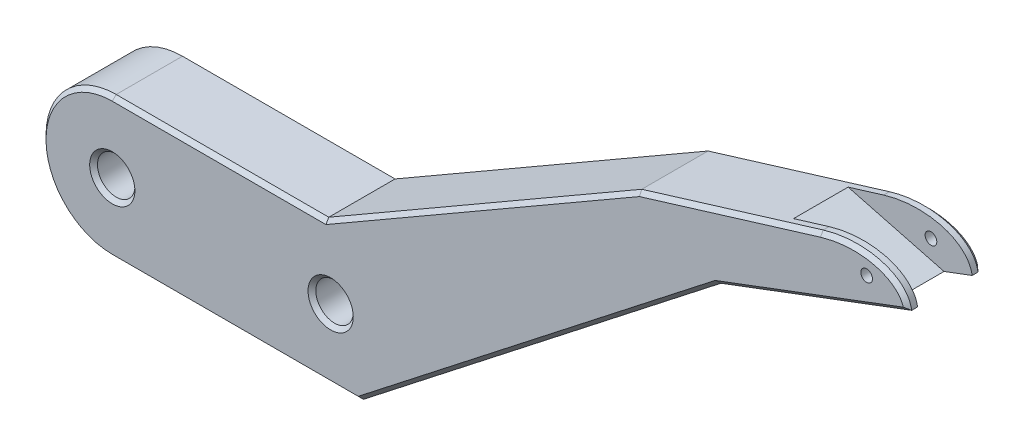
ISO-10303-21;
HEADER;
FILE_DESCRIPTION(('STEP AP214'),'2;1');
FILE_NAME('part.step','',(''),(''),'','','');
FILE_SCHEMA(('AUTOMOTIVE_DESIGN { 1 0 10303 214 1 1 1 1 }'));
ENDSEC;
DATA;
#1=APPLICATION_CONTEXT('core data for automotive mechanical design processes');
#2=APPLICATION_PROTOCOL_DEFINITION('international standard','automotive_design',2000,#1);
#3=PRODUCT_CONTEXT('',#1,'mechanical');
#4=PRODUCT('Part','Part','',(#3));
#5=PRODUCT_RELATED_PRODUCT_CATEGORY('part','',(#4));
#6=PRODUCT_DEFINITION_FORMATION('','',#4);
#7=PRODUCT_DEFINITION_CONTEXT('part definition',#1,'design');
#8=PRODUCT_DEFINITION('design','',#6,#7);
#9=PRODUCT_DEFINITION_SHAPE('','',#8);
#10=(LENGTH_UNIT() NAMED_UNIT(*) SI_UNIT(.MILLI.,.METRE.));
#11=(NAMED_UNIT(*) PLANE_ANGLE_UNIT() SI_UNIT($,.RADIAN.));
#12=(NAMED_UNIT(*) SI_UNIT($,.STERADIAN.) SOLID_ANGLE_UNIT());
#13=UNCERTAINTY_MEASURE_WITH_UNIT(LENGTH_MEASURE(1.E-05),#10,'distance_accuracy_value','');
#14=(GEOMETRIC_REPRESENTATION_CONTEXT(3) GLOBAL_UNCERTAINTY_ASSIGNED_CONTEXT((#13)) GLOBAL_UNIT_ASSIGNED_CONTEXT((#10,
#11,#12)) REPRESENTATION_CONTEXT('',''));
#15=CARTESIAN_POINT('',(0.,0.,0.));
#16=DIRECTION('',(0.,0.,1.));
#17=DIRECTION('',(1.,0.,0.));
#18=AXIS2_PLACEMENT_3D('',#15,#16,#17);
#19=CARTESIAN_POINT('',(121.009175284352,55.0295074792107,4.75));
#20=DIRECTION('',(-0.352653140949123,0.935754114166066,0.));
#21=DIRECTION('',(-0.935754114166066,-0.352653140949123,0.));
#22=AXIS2_PLACEMENT_3D('',#19,#20,#21);
#23=PLANE('',#22);
#24=DIRECTION('',(0.,0.,-1.));
#25=VECTOR('',#24,1.);
#26=CARTESIAN_POINT('',(96.5512893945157,45.8121819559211,4.75));
#27=LINE('',#26,#25);
#28=CARTESIAN_POINT('',(96.5512893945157,45.8121819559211,4.25));
#29=VERTEX_POINT('',#28);
#30=CARTESIAN_POINT('',(96.5512893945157,45.8121819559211,-4.25000000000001));
#31=VERTEX_POINT('',#30);
#32=EDGE_CURVE('E262',#29,#31,#27,.T.);
#33=ORIENTED_EDGE('',*,*,#32,.T.);
#34=DIRECTION('',(0.935754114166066,0.352653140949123,0.));
#35=VECTOR('',#34,1.);
#36=CARTESIAN_POINT('',(121.009175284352,55.0295074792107,-4.25000000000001));
#37=LINE('',#36,#35);
#38=CARTESIAN_POINT('',(121.009175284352,55.0295074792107,-4.24999999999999));
#39=VERTEX_POINT('',#38);
#40=EDGE_CURVE('E659',#31,#39,#37,.T.);
#41=ORIENTED_EDGE('',*,*,#40,.T.);
#42=CARTESIAN_POINT('',(121.009175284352,55.0295074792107,5.225));
#43=CARTESIAN_POINT('',(121.009175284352,55.0295074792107,1.74166666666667));
#44=CARTESIAN_POINT('',(121.009175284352,55.0295074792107,-1.74166666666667));
#45=CARTESIAN_POINT('',(121.009175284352,55.0295074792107,-5.225));
#46=(BOUNDED_CURVE() B_SPLINE_CURVE(3,(#42,#43,#44,#45),.UNSPECIFIED.,.F.,
.F.) B_SPLINE_CURVE_WITH_KNOTS((4,4),(-0.000475,0.009975),
.UNSPECIFIED.) CURVE() GEOMETRIC_REPRESENTATION_ITEM() RATIONAL_B_SPLINE_CURVE((0.999999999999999,
0.999999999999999,0.999999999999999,0.999999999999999)) REPRESENTATION_ITEM(''));
#47=CARTESIAN_POINT('',(121.009175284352,55.0295074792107,-3.5));
#48=VERTEX_POINT('',#47);
#49=EDGE_CURVE('E261',#48,#39,#46,.T.);
#50=ORIENTED_EDGE('',*,*,#49,.F.);
#51=DIRECTION('',(0.935754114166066,0.352653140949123,0.));
#52=VECTOR('',#51,1.);
#53=CARTESIAN_POINT('',(121.009175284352,55.0295074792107,-3.5));
#54=LINE('',#53,#52);
#55=CARTESIAN_POINT('',(117.4050546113,53.671239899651,-3.5));
#56=VERTEX_POINT('',#55);
#57=EDGE_CURVE('E210',#56,#48,#54,.T.);
#58=ORIENTED_EDGE('',*,*,#57,.F.);
#59=DIRECTION('',(0.,0.,1.));
#60=VECTOR('',#59,1.);
#61=CARTESIAN_POINT('',(117.4050546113,53.671239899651,4.75));
#62=LINE('',#61,#60);
#63=CARTESIAN_POINT('',(117.4050546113,53.671239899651,3.5));
#64=VERTEX_POINT('',#63);
#65=EDGE_CURVE('E219',#56,#64,#62,.T.);
#66=ORIENTED_EDGE('',*,*,#65,.T.);
#67=DIRECTION('',(0.935754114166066,0.352653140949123,0.));
#68=VECTOR('',#67,1.);
#69=CARTESIAN_POINT('',(121.009175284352,55.0295074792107,3.5));
#70=LINE('',#69,#68);
#71=CARTESIAN_POINT('',(121.009175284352,55.0295074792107,3.5));
#72=VERTEX_POINT('',#71);
#73=EDGE_CURVE('E227',#64,#72,#70,.T.);
#74=ORIENTED_EDGE('',*,*,#73,.T.);
#75=CARTESIAN_POINT('',(121.009175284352,55.0295074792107,5.225));
#76=CARTESIAN_POINT('',(121.009175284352,55.0295074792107,1.74166666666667));
#77=CARTESIAN_POINT('',(121.009175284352,55.0295074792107,-1.74166666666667));
#78=CARTESIAN_POINT('',(121.009175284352,55.0295074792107,-5.225));
#79=(BOUNDED_CURVE() B_SPLINE_CURVE(3,(#75,#76,#77,#78),.UNSPECIFIED.,.F.,
.F.) B_SPLINE_CURVE_WITH_KNOTS((4,4),(-0.000475,0.009975),
.UNSPECIFIED.) CURVE() GEOMETRIC_REPRESENTATION_ITEM() RATIONAL_B_SPLINE_CURVE((0.999999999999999,
0.999999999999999,0.999999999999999,0.999999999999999)) REPRESENTATION_ITEM(''));
#80=CARTESIAN_POINT('',(121.009175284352,55.0295074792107,4.24999999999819));
#81=VERTEX_POINT('',#80);
#82=EDGE_CURVE('E266',#81,#72,#79,.T.);
#83=ORIENTED_EDGE('',*,*,#82,.F.);
#84=DIRECTION('',(-0.935754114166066,-0.352653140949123,0.));
#85=VECTOR('',#84,1.);
#86=CARTESIAN_POINT('',(96.5512893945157,45.8121819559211,4.25));
#87=LINE('',#86,#85);
#88=EDGE_CURVE('E663',#81,#29,#87,.T.);
#89=ORIENTED_EDGE('',*,*,#88,.T.);
#90=EDGE_LOOP('',(#33,#41,#50,#58,#66,#74,#83,#89));
#91=FACE_BOUND('',#90,.T.);
#92=ADVANCED_FACE('F44',(#91),#23,.F.);
#93=CARTESIAN_POINT('',(86.3977765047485,51.1726147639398,4.75));
#94=DIRECTION('',(0.292371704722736,-0.956304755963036,0.));
#95=DIRECTION('',(0.956304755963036,0.292371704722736,0.));
#96=AXIS2_PLACEMENT_3D('',#93,#94,#95);
#97=PLANE('',#96);
#98=CARTESIAN_POINT('',(109.664301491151,58.2859053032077,-5.225));
#99=CARTESIAN_POINT('',(109.664301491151,58.2859053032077,-1.74166666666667));
#100=CARTESIAN_POINT('',(109.664301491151,58.2859053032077,1.74166666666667));
#101=CARTESIAN_POINT('',(109.664301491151,58.2859053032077,5.225));
#102=(BOUNDED_CURVE() B_SPLINE_CURVE(3,(#98,#99,#100,#101),.UNSPECIFIED.,.F.,
.F.) B_SPLINE_CURVE_WITH_KNOTS((4,4),(-0.000475,0.009975),
.UNSPECIFIED.) CURVE() GEOMETRIC_REPRESENTATION_ITEM() RATIONAL_B_SPLINE_CURVE((1.,1.,1.,1.)) REPRESENTATION_ITEM(''));
#103=CARTESIAN_POINT('',(109.664301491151,58.2859053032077,-3.5));
#104=VERTEX_POINT('',#103);
#105=CARTESIAN_POINT('',(109.664301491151,58.2859053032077,-4.24999999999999));
#106=VERTEX_POINT('',#105);
#107=EDGE_CURVE('E275',#104,#106,#102,.F.);
#108=ORIENTED_EDGE('',*,*,#107,.T.);
#109=DIRECTION('',(-0.956304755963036,-0.292371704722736,0.));
#110=VECTOR('',#109,1.);
#111=CARTESIAN_POINT('',(86.3977765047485,51.1726147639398,-4.24999999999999));
#112=LINE('',#111,#110);
#113=CARTESIAN_POINT('',(86.3977765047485,51.1726147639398,-4.24999999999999));
#114=VERTEX_POINT('',#113);
#115=EDGE_CURVE('E623',#106,#114,#112,.T.);
#116=ORIENTED_EDGE('',*,*,#115,.T.);
#117=DIRECTION('',(0.,0.,-1.));
#118=VECTOR('',#117,1.);
#119=CARTESIAN_POINT('',(86.3977765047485,51.1726147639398,4.75));
#120=LINE('',#119,#118);
#121=CARTESIAN_POINT('',(86.3977765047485,51.1726147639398,4.25000000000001));
#122=VERTEX_POINT('',#121);
#123=EDGE_CURVE('E258',#122,#114,#120,.T.);
#124=ORIENTED_EDGE('',*,*,#123,.F.);
#125=DIRECTION('',(0.956304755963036,0.292371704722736,0.));
#126=VECTOR('',#125,1.);
#127=CARTESIAN_POINT('',(109.664301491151,58.2859053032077,4.25));
#128=LINE('',#127,#126);
#129=CARTESIAN_POINT('',(109.664301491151,58.2859053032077,4.25000000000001));
#130=VERTEX_POINT('',#129);
#131=EDGE_CURVE('E627',#122,#130,#128,.T.);
#132=ORIENTED_EDGE('',*,*,#131,.T.);
#133=CARTESIAN_POINT('',(109.664301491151,58.2859053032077,-5.225));
#134=CARTESIAN_POINT('',(109.664301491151,58.2859053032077,-1.74166666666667));
#135=CARTESIAN_POINT('',(109.664301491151,58.2859053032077,1.74166666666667));
#136=CARTESIAN_POINT('',(109.664301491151,58.2859053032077,5.225));
#137=(BOUNDED_CURVE() B_SPLINE_CURVE(3,(#133,#134,#135,#136),.UNSPECIFIED.,.F.,
.F.) B_SPLINE_CURVE_WITH_KNOTS((4,4),(-0.000475,0.009975),
.UNSPECIFIED.) CURVE() GEOMETRIC_REPRESENTATION_ITEM() RATIONAL_B_SPLINE_CURVE((1.,1.,1.,1.)) REPRESENTATION_ITEM(''));
#138=CARTESIAN_POINT('',(109.664301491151,58.2859053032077,3.5));
#139=VERTEX_POINT('',#138);
#140=EDGE_CURVE('E333',#130,#139,#137,.F.);
#141=ORIENTED_EDGE('',*,*,#140,.T.);
#142=DIRECTION('',(-0.956304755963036,-0.292371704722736,0.));
#143=VECTOR('',#142,1.);
#144=CARTESIAN_POINT('',(86.3977765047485,51.1726147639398,3.5));
#145=LINE('',#144,#143);
#146=CARTESIAN_POINT('',(105.105451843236,56.8921250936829,3.5));
#147=VERTEX_POINT('',#146);
#148=EDGE_CURVE('E225',#139,#147,#145,.T.);
#149=ORIENTED_EDGE('',*,*,#148,.T.);
#150=DIRECTION('',(0.,0.,1.));
#151=VECTOR('',#150,1.);
#152=CARTESIAN_POINT('',(105.105451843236,56.8921250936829,-3.5));
#153=LINE('',#152,#151);
#154=CARTESIAN_POINT('',(105.105451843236,56.8921250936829,-3.5));
#155=VERTEX_POINT('',#154);
#156=EDGE_CURVE('E216',#155,#147,#153,.T.);
#157=ORIENTED_EDGE('',*,*,#156,.F.);
#158=DIRECTION('',(-0.956304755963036,-0.292371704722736,0.));
#159=VECTOR('',#158,1.);
#160=CARTESIAN_POINT('',(86.3977765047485,51.1726147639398,-3.5));
#161=LINE('',#160,#159);
#162=EDGE_CURVE('E199',#104,#155,#161,.T.);
#163=ORIENTED_EDGE('',*,*,#162,.F.);
#164=EDGE_LOOP('',(#108,#116,#124,#132,#141,#149,#157,#163));
#165=FACE_BOUND('',#164,.T.);
#166=ADVANCED_FACE('F223',(#165),#97,.F.);
#167=CARTESIAN_POINT('',(115.727753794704,56.5,4.75));
#168=DIRECTION('',(0.,0.,-1.));
#169=DIRECTION('',(-1.,0.,0.));
#170=AXIS2_PLACEMENT_3D('',#167,#168,#169);
#171=CYLINDRICAL_SURFACE('',#170,0.749999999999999);
#172=CARTESIAN_POINT('',(115.727753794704,56.5,-4.75));
#173=DIRECTION('',(0.,0.,1.));
#174=DIRECTION('',(1.,0.,0.));
#175=AXIS2_PLACEMENT_3D('',#172,#173,#174);
#176=CIRCLE('',#175,0.749999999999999);
#177=CARTESIAN_POINT('',(116.477753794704,56.5,-4.75));
#178=VERTEX_POINT('',#177);
#179=EDGE_CURVE('E253',#178,#178,#176,.T.);
#180=ORIENTED_EDGE('',*,*,#179,.F.);
#181=EDGE_LOOP('',(#180));
#182=FACE_BOUND('',#181,.T.);
#183=CARTESIAN_POINT('',(115.727753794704,56.5,-3.5));
#184=DIRECTION('',(0.,0.,1.));
#185=DIRECTION('',(1.,0.,0.));
#186=AXIS2_PLACEMENT_3D('',#183,#184,#185);
#187=CIRCLE('',#186,0.749999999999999);
#188=CARTESIAN_POINT('',(116.477753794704,56.5,-3.5));
#189=VERTEX_POINT('',#188);
#190=EDGE_CURVE('E242',#189,#189,#187,.T.);
#191=ORIENTED_EDGE('',*,*,#190,.T.);
#192=EDGE_LOOP('',(#191));
#193=FACE_BOUND('',#192,.T.);
#194=ADVANCED_FACE('F296',(#182,#193),#171,.F.);
#195=CARTESIAN_POINT('',(109.664301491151,58.2859053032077,5.225));
#196=CARTESIAN_POINT('',(109.664301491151,58.2859053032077,1.74166666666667));
#197=CARTESIAN_POINT('',(109.664301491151,58.2859053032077,-1.74166666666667));
#198=CARTESIAN_POINT('',(109.664301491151,58.2859053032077,-5.225));
#199=CARTESIAN_POINT('',(120.018162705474,61.4513983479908,5.225));
#200=CARTESIAN_POINT('',(120.018162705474,61.4513983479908,1.74166666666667));
#201=CARTESIAN_POINT('',(120.018162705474,61.4513983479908,-1.74166666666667));
#202=CARTESIAN_POINT('',(120.018162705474,61.4513983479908,-5.225));
#203=CARTESIAN_POINT('',(121.009175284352,55.0295074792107,5.225));
#204=CARTESIAN_POINT('',(121.009175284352,55.0295074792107,1.74166666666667));
#205=CARTESIAN_POINT('',(121.009175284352,55.0295074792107,-1.74166666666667));
#206=CARTESIAN_POINT('',(121.009175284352,55.0295074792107,-5.225));
#207=(BOUNDED_SURFACE() B_SPLINE_SURFACE(2,3,((#195,#196,#197,#198),(#199,#200,#201,#202),(#203,
#204,#205,#206)),.UNSPECIFIED.,.F.,.F.,.F.) B_SPLINE_SURFACE_WITH_KNOTS((3,3),(4,4),(0.,1.),
(-0.000475,0.009975),
.UNSPECIFIED.) GEOMETRIC_REPRESENTATION_ITEM() RATIONAL_B_SPLINE_SURFACE(((1.,1.,1.,1.),
(0.65455982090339,0.65455982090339,0.65455982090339,0.65455982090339),(1.,1.,1.,1.))) REPRESENTATION_ITEM('') SURFACE());
#208=CARTESIAN_POINT('',(121.009175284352,55.0295074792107,-4.24999999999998));
#209=CARTESIAN_POINT('',(120.018162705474,61.4513983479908,-4.24999999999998));
#210=CARTESIAN_POINT('',(109.664301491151,58.2859053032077,-4.24999999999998));
#211=(BOUNDED_CURVE() B_SPLINE_CURVE(2,(#208,#209,#210),.UNSPECIFIED.,.F.,
.F.) B_SPLINE_CURVE_WITH_KNOTS((3,3),(0.,1.),
.UNSPECIFIED.) CURVE() GEOMETRIC_REPRESENTATION_ITEM() RATIONAL_B_SPLINE_CURVE((1.,
0.65455982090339,1.)) REPRESENTATION_ITEM(''));
#212=EDGE_CURVE('E505',#39,#106,#211,.T.);
#213=CARTESIAN_POINT('',(109.664301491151,58.2859053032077,-3.5));
#214=CARTESIAN_POINT('',(109.905447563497,58.3596077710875,-3.5));
#215=CARTESIAN_POINT('',(110.148365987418,58.4275126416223,-3.5));
#216=CARTESIAN_POINT('',(110.637412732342,58.5516234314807,-3.5));
#217=CARTESIAN_POINT('',(110.883543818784,58.6078184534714,-3.5));
#218=CARTESIAN_POINT('',(111.378323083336,58.7082870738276,-3.5));
#219=CARTESIAN_POINT('',(111.62697215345,58.752556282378,-3.5));
#220=CARTESIAN_POINT('',(112.128662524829,58.8292077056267,-3.5));
#221=CARTESIAN_POINT('',(112.38172284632,58.8614658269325,-3.5));
#222=CARTESIAN_POINT('',(112.889105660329,58.9129857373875,-3.5));
#223=CARTESIAN_POINT('',(113.143427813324,58.9322508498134,-3.5));
#224=CARTESIAN_POINT('',(113.652704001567,58.9571535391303,-3.5));
#225=CARTESIAN_POINT('',(113.907657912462,58.9627936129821,-3.5));
#226=CARTESIAN_POINT('',(114.420142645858,58.9595976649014,-3.5));
#227=CARTESIAN_POINT('',(114.6776727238,58.9506106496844,-3.5));
#228=CARTESIAN_POINT('',(115.191589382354,58.9167702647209,-3.5));
#229=CARTESIAN_POINT('',(115.44797646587,58.8919247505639,-3.5));
#230=CARTESIAN_POINT('',(115.957719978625,58.8250696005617,-3.5));
#231=CARTESIAN_POINT('',(116.211083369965,58.7831137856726,-3.5));
#232=CARTESIAN_POINT('',(116.714417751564,58.680197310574,-3.5));
#233=CARTESIAN_POINT('',(116.964382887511,58.6192073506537,-3.5));
#234=CARTESIAN_POINT('',(117.381574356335,58.498277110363,-3.5));
#235=CARTESIAN_POINT('',(117.550413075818,58.4438801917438,-3.5));
#236=CARTESIAN_POINT('',(117.884254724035,58.3241418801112,-3.5));
#237=CARTESIAN_POINT('',(118.049256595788,58.2587975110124,-3.5));
#238=CARTESIAN_POINT('',(118.373657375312,58.1164261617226,-3.5));
#239=CARTESIAN_POINT('',(118.533069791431,58.0394301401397,-3.5));
#240=CARTESIAN_POINT('',(118.845048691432,57.8726490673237,-3.5));
#241=CARTESIAN_POINT('',(118.997618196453,57.7828697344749,-3.5));
#242=CARTESIAN_POINT('',(119.249108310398,57.6187086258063,-3.5));
#243=CARTESIAN_POINT('',(119.350332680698,57.5478481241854,-3.5));
#244=CARTESIAN_POINT('',(119.547506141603,57.3991183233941,-3.5));
#245=CARTESIAN_POINT('',(119.643455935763,57.3212499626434,-3.5));
#246=CARTESIAN_POINT('',(119.828952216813,57.1583649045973,-3.5));
#247=CARTESIAN_POINT('',(119.918504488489,57.0733548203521,-3.5));
#248=CARTESIAN_POINT('',(120.09008801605,56.8960678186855,-3.5));
#249=CARTESIAN_POINT('',(120.17212186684,56.8037934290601,-3.5));
#250=CARTESIAN_POINT('',(120.313127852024,56.6297045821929,-3.5));
#251=CARTESIAN_POINT('',(120.373569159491,56.5490791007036,-3.5));
#252=CARTESIAN_POINT('',(120.487827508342,56.3833106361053,-3.5));
#253=CARTESIAN_POINT('',(120.541648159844,56.2981701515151,-3.5));
#254=CARTESIAN_POINT('',(120.641927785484,56.1237864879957,-3.5));
#255=CARTESIAN_POINT('',(120.688395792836,56.0345485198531,-3.5));
#256=CARTESIAN_POINT('',(120.773398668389,55.8524080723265,-3.5));
#257=CARTESIAN_POINT('',(120.811936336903,55.7595069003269,-3.5));
#258=CARTESIAN_POINT('',(120.883671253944,55.5621468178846,-3.5));
#259=CARTESIAN_POINT('',(120.916080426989,55.4573982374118,-3.5));
#260=CARTESIAN_POINT('',(120.956877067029,55.2982855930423,-3.5));
#261=CARTESIAN_POINT('',(120.969176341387,55.2448953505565,-3.5));
#262=CARTESIAN_POINT('',(120.991148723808,55.1375767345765,-3.5));
#263=CARTESIAN_POINT('',(121.000821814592,55.0836483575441,-3.5));
#264=CARTESIAN_POINT('',(121.009175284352,55.0295074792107,-3.5));
#265=B_SPLINE_CURVE_WITH_KNOTS('',3,(#213,#214,#215,#216,#217,#218,#219,#220,#221,#222,#223,
#224,#225,#226,#227,#228,#229,#230,#231,#232,#233,#234,#235,#236,#237,#238,#239,#240,#241,#242,
#243,#244,#245,#246,#247,#248,#249,#250,#251,#252,#253,#254,#255,#256,#257,#258,#259,#260,#261,
#262,#263,#264),.UNSPECIFIED.,.F.,.F.,(4,2,2,2,2,2,2,2,2,2,2,2,2,2,2,2,2,2,2,2,2,2,2,2,2,4),(0.,
0.756400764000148,1.51350233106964,2.27088220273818,3.03588309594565,3.80068824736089,
4.56535322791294,5.33796191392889,6.11018818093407,6.8800038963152,7.65101050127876,
8.18284515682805,8.71482462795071,9.24541466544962,9.77576809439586,10.1461858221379,
10.5165540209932,10.886582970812,11.2564837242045,11.5584873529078,11.8603255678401,
12.1617900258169,12.4631478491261,12.7915119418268,12.9558213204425,13.120131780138),.UNSPECIFIED.);
#266=EDGE_CURVE('E205',#104,#48,#265,.T.);
#267=ORIENTED_EDGE('',*,*,#49,.T.);
#268=ORIENTED_EDGE('',*,*,#212,.T.);
#269=ORIENTED_EDGE('',*,*,#107,.F.);
#270=ORIENTED_EDGE('',*,*,#266,.T.);
#271=EDGE_LOOP('',(#267,#268,#269,#270));
#272=FACE_BOUND('',#271,.T.);
#273=ADVANCED_FACE('F378',(#272),#207,.T.);
#274=CARTESIAN_POINT('',(0.,0.,4.75));
#275=DIRECTION('',(0.,0.,1.));
#276=DIRECTION('',(1.,0.,0.));
#277=AXIS2_PLACEMENT_3D('',#274,#275,#276);
#278=PLANE('',#277);
#279=CARTESIAN_POINT('',(47.,19.,4.75));
#280=DIRECTION('',(0.,0.,1.));
#281=DIRECTION('',(1.,0.,0.));
#282=AXIS2_PLACEMENT_3D('',#279,#280,#281);
#283=CIRCLE('',#282,2.90000000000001);
#284=CARTESIAN_POINT('',(49.9,19.,4.75));
#285=VERTEX_POINT('',#284);
#286=EDGE_CURVE('E56',#285,#285,#283,.F.);
#287=ORIENTED_EDGE('',*,*,#286,.T.);
#288=EDGE_LOOP('',(#287));
#289=FACE_BOUND('',#288,.T.);
#290=CARTESIAN_POINT('',(19.,19.,4.75));
#291=DIRECTION('',(0.,0.,1.));
#292=DIRECTION('',(1.,0.,0.));
#293=AXIS2_PLACEMENT_3D('',#290,#291,#292);
#294=CIRCLE('',#293,2.89999999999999);
#295=CARTESIAN_POINT('',(21.9,19.,4.75));
#296=VERTEX_POINT('',#295);
#297=EDGE_CURVE('E402',#296,#296,#294,.F.);
#298=ORIENTED_EDGE('',*,*,#297,.T.);
#299=EDGE_LOOP('',(#298));
#300=FACE_BOUND('',#299,.T.);
#301=DIRECTION('',(1.,0.,0.));
#302=VECTOR('',#301,1.);
#303=CARTESIAN_POINT('',(50.7137867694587,10.5,4.75));
#304=LINE('',#303,#302);
#305=CARTESIAN_POINT('',(19.,10.5,4.75));
#306=VERTEX_POINT('',#305);
#307=CARTESIAN_POINT('',(50.5416229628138,10.5,4.75));
#308=VERTEX_POINT('',#307);
#309=EDGE_CURVE('E71',#306,#308,#304,.T.);
#310=ORIENTED_EDGE('',*,*,#309,.T.);
#311=DIRECTION('',(0.788010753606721,0.61566147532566,0.));
#312=VECTOR('',#311,1.);
#313=CARTESIAN_POINT('',(96.2434586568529,46.2061873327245,4.75));
#314=LINE('',#313,#312);
#315=CARTESIAN_POINT('',(96.303575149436,46.2531554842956,4.75));
#316=VERTEX_POINT('',#315);
#317=EDGE_CURVE('E398',#308,#316,#314,.T.);
#318=ORIENTED_EDGE('',*,*,#317,.T.);
#319=DIRECTION('',(0.935754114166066,0.352653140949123,0.));
#320=VECTOR('',#319,1.);
#321=CARTESIAN_POINT('',(120.832848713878,55.4973845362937,4.75));
#322=LINE('',#321,#320);
#323=CARTESIAN_POINT('',(120.426273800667,55.3441606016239,4.75));
#324=VERTEX_POINT('',#323);
#325=EDGE_CURVE('E396',#316,#324,#322,.T.);
#326=ORIENTED_EDGE('',*,*,#325,.T.);
#327=CARTESIAN_POINT('',(109.810487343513,57.8077529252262,4.75));
#328=CARTESIAN_POINT('',(110.068065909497,57.8864991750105,4.74999999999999));
#329=CARTESIAN_POINT('',(110.326584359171,57.9580290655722,4.75));
#330=CARTESIAN_POINT('',(110.845446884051,58.0870718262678,4.74999999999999));
#331=CARTESIAN_POINT('',(111.105790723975,58.1445865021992,4.75));
#332=CARTESIAN_POINT('',(111.628291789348,58.2456928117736,4.75));
#333=CARTESIAN_POINT('',(111.890448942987,58.2892849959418,4.75));
#334=CARTESIAN_POINT('',(112.416608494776,58.3623017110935,4.75));
#335=CARTESIAN_POINT('',(112.680610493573,58.3917293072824,4.75));
#336=CARTESIAN_POINT('',(113.210538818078,58.4358096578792,4.75));
#337=CARTESIAN_POINT('',(113.476464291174,58.4504689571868,4.75000000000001));
#338=CARTESIAN_POINT('',(113.876898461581,58.4605881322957,4.75));
#339=CARTESIAN_POINT('',(114.010634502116,58.4619804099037,4.75));
#340=CARTESIAN_POINT('',(114.278647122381,58.460614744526,4.74999999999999));
#341=CARTESIAN_POINT('',(114.412932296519,58.4578563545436,4.75));
#342=CARTESIAN_POINT('',(114.614761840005,58.4504372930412,4.75));
#343=CARTESIAN_POINT('',(114.68215241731,58.4474131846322,4.75));
#344=CARTESIAN_POINT('',(114.816897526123,58.4402458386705,4.75));
#345=CARTESIAN_POINT('',(114.884163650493,58.4361082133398,4.75));
#346=CARTESIAN_POINT('',(115.085637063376,58.4220003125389,4.75));
#347=CARTESIAN_POINT('',(115.219619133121,58.4103351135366,4.75));
#348=CARTESIAN_POINT('',(115.486734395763,58.3822948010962,4.75));
#349=CARTESIAN_POINT('',(115.619892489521,58.3659195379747,4.75));
#350=CARTESIAN_POINT('',(115.885367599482,58.3282112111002,4.75));
#351=CARTESIAN_POINT('',(116.017684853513,58.306879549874,4.75));
#352=CARTESIAN_POINT('',(116.413295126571,58.2349770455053,4.74999999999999));
#353=CARTESIAN_POINT('',(116.675293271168,58.1765418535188,4.75000000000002));
#354=CARTESIAN_POINT('',(117.000098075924,58.0882035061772,4.75));
#355=CARTESIAN_POINT('',(117.064958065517,58.0697495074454,4.75));
#356=CARTESIAN_POINT('',(117.194337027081,58.0312485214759,4.75));
#357=CARTESIAN_POINT('',(117.258984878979,58.0111562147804,4.75));
#358=CARTESIAN_POINT('',(117.387440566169,57.969446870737,4.75));
#359=CARTESIAN_POINT('',(117.451306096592,57.947815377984,4.75000000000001));
#360=CARTESIAN_POINT('',(117.578269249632,57.902946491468,4.74999999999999));
#361=CARTESIAN_POINT('',(117.64136973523,57.8797086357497,4.75));
#362=CARTESIAN_POINT('',(117.829482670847,57.8074894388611,4.74999999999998));
#363=CARTESIAN_POINT('',(117.953309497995,57.7560085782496,4.75));
#364=CARTESIAN_POINT('',(118.197503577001,57.6457534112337,4.75));
#365=CARTESIAN_POINT('',(118.317872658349,57.5869829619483,4.75000000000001));
#366=CARTESIAN_POINT('',(118.495539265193,57.4927409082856,4.75));
#367=CARTESIAN_POINT('',(118.554279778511,57.4603113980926,4.74999999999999));
#368=CARTESIAN_POINT('',(118.670735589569,57.3932910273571,4.75));
#369=CARTESIAN_POINT('',(118.728451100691,57.3587006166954,4.74999999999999));
#370=CARTESIAN_POINT('',(118.842785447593,57.2872077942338,4.75000000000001));
#371=CARTESIAN_POINT('',(118.899394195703,57.250311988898,4.75));
#372=CARTESIAN_POINT('',(118.983452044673,57.1930815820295,4.75));
#373=CARTESIAN_POINT('',(119.011338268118,57.1736812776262,4.75));
#374=CARTESIAN_POINT('',(119.066577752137,57.1343954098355,4.74999999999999));
#375=CARTESIAN_POINT('',(119.093965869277,57.1144879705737,4.74999999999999));
#376=CARTESIAN_POINT('',(119.229627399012,57.0136428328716,4.74999999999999));
#377=CARTESIAN_POINT('',(119.33423666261,56.9287339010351,4.75000000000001));
#378=CARTESIAN_POINT('',(119.484579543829,56.7943390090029,4.75));
#379=CARTESIAN_POINT('',(119.533599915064,56.7483668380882,4.75));
#380=CARTESIAN_POINT('',(119.629314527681,56.6539263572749,4.75));
#381=CARTESIAN_POINT('',(119.676009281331,56.6054585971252,4.75));
#382=CARTESIAN_POINT('',(119.766911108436,56.5058535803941,4.75));
#383=CARTESIAN_POINT('',(119.811121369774,56.4547093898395,4.75));
#384=CARTESIAN_POINT('',(119.896849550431,56.3495733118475,4.75));
#385=CARTESIAN_POINT('',(119.938450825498,56.2954344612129,4.75000000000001));
#386=CARTESIAN_POINT('',(120.017662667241,56.1856044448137,4.75));
#387=CARTESIAN_POINT('',(120.055499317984,56.129646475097,4.75000000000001));
#388=CARTESIAN_POINT('',(120.127384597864,56.0157463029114,4.75));
#389=CARTESIAN_POINT('',(120.161456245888,55.9577770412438,4.75));
#390=CARTESIAN_POINT('',(120.225723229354,55.8397269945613,4.75));
#391=CARTESIAN_POINT('',(120.255918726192,55.7796462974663,4.75));
#392=CARTESIAN_POINT('',(120.312274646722,55.6572868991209,4.75));
#393=CARTESIAN_POINT('',(120.33843999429,55.5949881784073,4.75));
#394=CARTESIAN_POINT('',(120.374507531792,55.4998757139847,4.75));
#395=CARTESIAN_POINT('',(120.386007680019,55.4678613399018,4.75));
#396=CARTESIAN_POINT('',(120.407917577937,55.4032734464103,4.75));
#397=CARTESIAN_POINT('',(120.418266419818,55.3708782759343,4.75000000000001));
#398=CARTESIAN_POINT('',(120.437755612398,55.3059039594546,4.74999999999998));
#399=CARTESIAN_POINT('',(120.446904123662,55.2733067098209,4.75));
#400=CARTESIAN_POINT('',(120.464006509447,55.2079245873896,4.75));
#401=CARTESIAN_POINT('',(120.471962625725,55.1751345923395,4.75));
#402=CARTESIAN_POINT('',(120.483011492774,55.1258024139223,4.75));
#403=CARTESIAN_POINT('',(120.486546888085,55.109333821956,4.75));
#404=CARTESIAN_POINT('',(120.493323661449,55.0763477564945,4.75));
#405=CARTESIAN_POINT('',(120.496565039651,55.0598302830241,4.74999999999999));
#406=CARTESIAN_POINT('',(120.501207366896,55.035017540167,4.75));
#407=CARTESIAN_POINT('',(120.502718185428,55.0267405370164,4.75));
#408=CARTESIAN_POINT('',(120.505666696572,55.0101743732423,4.75));
#409=CARTESIAN_POINT('',(120.507104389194,55.0018852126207,4.75000000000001));
#410=CARTESIAN_POINT('',(120.509906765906,54.9852947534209,4.74999999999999));
#411=CARTESIAN_POINT('',(120.511270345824,54.9769932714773,4.74999999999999));
#412=CARTESIAN_POINT('',(120.51293202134,54.966609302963,4.75));
#413=CARTESIAN_POINT('',(120.513261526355,54.9645320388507,4.75000000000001));
#414=CARTESIAN_POINT('',(120.51375278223,54.9614156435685,4.74999999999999));
#415=CARTESIAN_POINT('',(120.513915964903,54.9603767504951,4.75));
#416=CARTESIAN_POINT('',(120.51424119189,54.9582987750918,4.75));
#417=CARTESIAN_POINT('',(120.514403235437,54.9572596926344,4.74999999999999));
#418=CARTESIAN_POINT('',(120.514645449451,54.955700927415,4.75));
#419=CARTESIAN_POINT('',(120.514726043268,54.9551813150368,4.75000000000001));
#420=CARTESIAN_POINT('',(120.514886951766,54.9541420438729,4.75));
#421=CARTESIAN_POINT('',(120.514967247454,54.9536223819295,4.75000000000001));
#422=CARTESIAN_POINT('',(120.515127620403,54.9525830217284,4.74999999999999));
#423=CARTESIAN_POINT('',(120.515207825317,54.9520633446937,4.75));
#424=CARTESIAN_POINT('',(120.515368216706,54.9510239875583,4.75));
#425=CARTESIAN_POINT('',(120.515448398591,54.9505043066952,4.75));
#426=CARTESIAN_POINT('',(120.515849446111,54.947905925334,4.75));
#427=CARTESIAN_POINT('',(120.51617017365,54.9458272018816,4.75));
#428=CARTESIAN_POINT('',(120.516811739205,54.9416697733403,4.75));
#429=CARTESIAN_POINT('',(120.517132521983,54.9395910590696,4.75));
#430=CARTESIAN_POINT('',(120.517774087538,54.9354336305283,4.75));
#431=CARTESIAN_POINT('',(120.518094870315,54.9333549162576,4.75));
#432=CARTESIAN_POINT('',(120.519057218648,54.9271187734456,4.75));
#433=CARTESIAN_POINT('',(120.519698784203,54.9229613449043,4.75));
#434=CARTESIAN_POINT('',(120.521623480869,54.9104890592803,4.75));
#435=CARTESIAN_POINT('',(120.522906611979,54.9021742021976,4.75));
#436=CARTESIAN_POINT('',(120.52675600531,54.8772296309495,4.75));
#437=CARTESIAN_POINT('',(120.52932226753,54.8605999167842,4.75));
#438=CARTESIAN_POINT('',(120.537021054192,54.8107107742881,4.75));
#439=CARTESIAN_POINT('',(120.542153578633,54.7774513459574,4.75));
#440=CARTESIAN_POINT('',(120.557551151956,54.6776730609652,4.75));
#441=CARTESIAN_POINT('',(120.567816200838,54.6111542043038,4.75));
#442=CARTESIAN_POINT('',(120.588346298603,54.4781164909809,4.75));
#443=CARTESIAN_POINT('',(120.598611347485,54.4115976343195,4.75));
#444=CARTESIAN_POINT('',(120.608876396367,54.3450787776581,4.75));
#445=B_SPLINE_CURVE_WITH_KNOTS('',3,(#327,#328,#329,#330,#331,#332,#333,#334,#335,#336,#337,
#338,#339,#340,#341,#342,#343,#344,#345,#346,#347,#348,#349,#350,#351,#352,#353,#354,#355,#356,
#357,#358,#359,#360,#361,#362,#363,#364,#365,#366,#367,#368,#369,#370,#371,#372,#373,#374,#375,
#376,#377,#378,#379,#380,#381,#382,#383,#384,#385,#386,#387,#388,#389,#390,#391,#392,#393,#394,
#395,#396,#397,#398,#399,#400,#401,#402,#403,#404,#405,#406,#407,#408,#409,#410,#411,#412,#413,
#414,#415,#416,#417,#418,#419,#420,#421,#422,#423,#424,#425,#426,#427,#428,#429,#430,#431,#432,
#433,#434,#435,#436,#437,#438,#439,#440,#441,#442,#443,#444),.UNSPECIFIED.,.F.,.F.,(4,2,2,2,2,2,
2,2,2,2,2,2,2,2,2,2,2,2,2,2,2,2,2,2,2,2,2,2,2,2,2,2,2,2,2,2,2,2,2,2,2,2,2,2,2,2,2,2,2,2,2,2,2,2,
2,2,2,2,4),(0.,0.000796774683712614,0.00159354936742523,0.00239032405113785,0.00318709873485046,
0.00398387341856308,0.00438226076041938,0.00478064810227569,0.00497984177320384,
0.005179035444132,0.00557742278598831,0.00597581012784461,0.00637419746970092,
0.00717097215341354,0.00737016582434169,0.00756935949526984,0.007768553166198,
0.00796774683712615,0.00836613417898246,0.00876452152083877,0.00896371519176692,
0.00916290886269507,0.00936210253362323,0.0094616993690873,0.00956129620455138,
0.00995968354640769,0.0101588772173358,0.010358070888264,0.0105572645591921,0.0107564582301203,
0.0109556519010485,0.0111548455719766,0.0113540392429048,0.0115532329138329,0.011652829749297,
0.0117524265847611,0.0118520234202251,0.0119516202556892,0.0120014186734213,0.0120512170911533,
0.0120761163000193,0.0121010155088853,0.0121259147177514,0.0121321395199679,0.0121352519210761,
0.0121383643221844,0.0121399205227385,0.0121414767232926,0.0121430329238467,0.0121445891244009,
0.0121508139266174,0.0121570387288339,0.0121632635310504,0.0121757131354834,0.0122006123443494,
0.0122504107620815,0.0123500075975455,0.0125492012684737,0.0127483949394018),.UNSPECIFIED.);
#446=CARTESIAN_POINT('',(109.810487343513,57.8077529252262,4.75));
#447=VERTEX_POINT('',#446);
#448=EDGE_CURVE('E394',#324,#447,#445,.F.);
#449=ORIENTED_EDGE('',*,*,#448,.T.);
#450=DIRECTION('',(-0.956304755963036,-0.292371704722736,0.));
#451=VECTOR('',#450,1.);
#452=CARTESIAN_POINT('',(86.5439623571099,50.6944623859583,4.75));
#453=LINE('',#452,#451);
#454=CARTESIAN_POINT('',(86.5984409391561,50.7111181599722,4.75));
#455=VERTEX_POINT('',#454);
#456=EDGE_CURVE('E604',#447,#455,#453,.T.);
#457=ORIENTED_EDGE('',*,*,#456,.T.);
#458=DIRECTION('',(-0.866025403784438,-0.500000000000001,0.));
#459=VECTOR('',#458,1.);
#460=CARTESIAN_POINT('',(46.5116303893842,27.5669872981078,4.75));
#461=LINE('',#460,#459);
#462=CARTESIAN_POINT('',(46.3956049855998,27.5,4.75));
#463=VERTEX_POINT('',#462);
#464=EDGE_CURVE('E607',#455,#463,#461,.T.);
#465=ORIENTED_EDGE('',*,*,#464,.T.);
#466=DIRECTION('',(-1.,0.,0.));
#467=VECTOR('',#466,1.);
#468=CARTESIAN_POINT('',(19.,27.5,4.75));
#469=LINE('',#468,#467);
#470=CARTESIAN_POINT('',(19.,27.5,4.75));
#471=VERTEX_POINT('',#470);
#472=EDGE_CURVE('E613',#463,#471,#469,.T.);
#473=ORIENTED_EDGE('',*,*,#472,.T.);
#474=CARTESIAN_POINT('',(19.,19.,4.75));
#475=DIRECTION('',(0.,0.,1.));
#476=DIRECTION('',(1.,0.,0.));
#477=AXIS2_PLACEMENT_3D('',#474,#475,#476);
#478=CIRCLE('',#477,8.50000000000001);
#479=CARTESIAN_POINT('',(10.5,19.,4.75));
#480=VERTEX_POINT('',#479);
#481=EDGE_CURVE('E603',#471,#480,#478,.T.);
#482=ORIENTED_EDGE('',*,*,#481,.T.);
#483=CARTESIAN_POINT('',(19.,19.,4.75));
#484=DIRECTION('',(0.,0.,1.));
#485=DIRECTION('',(1.,0.,0.));
#486=AXIS2_PLACEMENT_3D('',#483,#484,#485);
#487=CIRCLE('',#486,8.50000000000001);
#488=EDGE_CURVE('E387',#480,#306,#487,.T.);
#489=ORIENTED_EDGE('',*,*,#488,.T.);
#490=EDGE_LOOP('',(#310,#318,#326,#449,#457,#465,#473,#482,#489));
#491=FACE_BOUND('',#490,.T.);
#492=CARTESIAN_POINT('',(115.727753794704,56.5,4.75));
#493=DIRECTION('',(0.,0.,1.));
#494=DIRECTION('',(1.,0.,0.));
#495=AXIS2_PLACEMENT_3D('',#492,#493,#494);
#496=CIRCLE('',#495,0.749999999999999);
#497=CARTESIAN_POINT('',(116.477753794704,56.5,4.75));
#498=VERTEX_POINT('',#497);
#499=EDGE_CURVE('E249',#498,#498,#496,.T.);
#500=ORIENTED_EDGE('',*,*,#499,.F.);
#501=EDGE_LOOP('',(#500));
#502=FACE_BOUND('',#501,.T.);
#503=ADVANCED_FACE('F373',(#289,#300,#491,#502),#278,.T.);
#504=CARTESIAN_POINT('',(0.,0.,-4.75));
#505=DIRECTION('',(0.,0.,1.));
#506=DIRECTION('',(1.,0.,0.));
#507=AXIS2_PLACEMENT_3D('',#504,#505,#506);
#508=PLANE('',#507);
#509=CARTESIAN_POINT('',(19.,19.,-4.75));
#510=DIRECTION('',(0.,0.,1.));
#511=DIRECTION('',(1.,0.,0.));
#512=AXIS2_PLACEMENT_3D('',#509,#510,#511);
#513=CIRCLE('',#512,2.89999999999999);
#514=CARTESIAN_POINT('',(21.9,19.,-4.75));
#515=VERTEX_POINT('',#514);
#516=EDGE_CURVE('E720',#515,#515,#513,.T.);
#517=ORIENTED_EDGE('',*,*,#516,.T.);
#518=EDGE_LOOP('',(#517));
#519=FACE_BOUND('',#518,.T.);
#520=CARTESIAN_POINT('',(47.,19.,-4.75));
#521=DIRECTION('',(0.,0.,1.));
#522=DIRECTION('',(1.,0.,0.));
#523=AXIS2_PLACEMENT_3D('',#520,#521,#522);
#524=CIRCLE('',#523,2.9);
#525=CARTESIAN_POINT('',(49.9,19.,-4.75));
#526=VERTEX_POINT('',#525);
#527=EDGE_CURVE('E715',#526,#526,#524,.T.);
#528=ORIENTED_EDGE('',*,*,#527,.T.);
#529=EDGE_LOOP('',(#528));
#530=FACE_BOUND('',#529,.T.);
#531=CARTESIAN_POINT('',(120.608876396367,54.3450787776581,-4.75));
#532=CARTESIAN_POINT('',(120.598611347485,54.4115976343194,-4.75));
#533=CARTESIAN_POINT('',(120.588346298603,54.4781164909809,-4.75));
#534=CARTESIAN_POINT('',(120.567816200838,54.6111542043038,-4.75));
#535=CARTESIAN_POINT('',(120.557551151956,54.6776730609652,-4.74999999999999));
#536=CARTESIAN_POINT('',(120.542153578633,54.7774513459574,-4.75));
#537=CARTESIAN_POINT('',(120.537021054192,54.8107107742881,-4.75));
#538=CARTESIAN_POINT('',(120.52932226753,54.8605999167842,-4.75));
#539=CARTESIAN_POINT('',(120.52675600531,54.8772296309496,-4.75000000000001));
#540=CARTESIAN_POINT('',(120.522906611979,54.9021742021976,-4.75));
#541=CARTESIAN_POINT('',(120.521623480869,54.9104890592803,-4.75));
#542=CARTESIAN_POINT('',(120.519698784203,54.9229613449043,-4.75));
#543=CARTESIAN_POINT('',(120.519057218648,54.9271187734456,-4.75000000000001));
#544=CARTESIAN_POINT('',(120.518094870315,54.9333549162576,-4.75));
#545=CARTESIAN_POINT('',(120.517774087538,54.9354336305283,-4.75));
#546=CARTESIAN_POINT('',(120.517132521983,54.9395910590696,-4.75));
#547=CARTESIAN_POINT('',(120.516811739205,54.9416697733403,-4.75));
#548=CARTESIAN_POINT('',(120.51617017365,54.9458272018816,-4.75));
#549=CARTESIAN_POINT('',(120.515849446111,54.947905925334,-4.75000000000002));
#550=CARTESIAN_POINT('',(120.515448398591,54.9505043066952,-4.75));
#551=CARTESIAN_POINT('',(120.515368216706,54.9510239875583,-4.75));
#552=CARTESIAN_POINT('',(120.515207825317,54.9520633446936,-4.75));
#553=CARTESIAN_POINT('',(120.515127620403,54.9525830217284,-4.75));
#554=CARTESIAN_POINT('',(120.514967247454,54.9536223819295,-4.75));
#555=CARTESIAN_POINT('',(120.514886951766,54.9541420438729,-4.74999999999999));
#556=CARTESIAN_POINT('',(120.514726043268,54.9551813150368,-4.75));
#557=CARTESIAN_POINT('',(120.514645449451,54.9557009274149,-4.74999999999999));
#558=CARTESIAN_POINT('',(120.514403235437,54.9572596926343,-4.75000000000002));
#559=CARTESIAN_POINT('',(120.51424119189,54.9582987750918,-4.75000000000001));
#560=CARTESIAN_POINT('',(120.513915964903,54.9603767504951,-4.74999999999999));
#561=CARTESIAN_POINT('',(120.51375278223,54.9614156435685,-4.75));
#562=CARTESIAN_POINT('',(120.513261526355,54.9645320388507,-4.74999999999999));
#563=CARTESIAN_POINT('',(120.51293202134,54.9666093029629,-4.75));
#564=CARTESIAN_POINT('',(120.511270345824,54.9769932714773,-4.75));
#565=CARTESIAN_POINT('',(120.509906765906,54.985294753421,-4.75));
#566=CARTESIAN_POINT('',(120.507104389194,55.0018852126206,-4.75000000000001));
#567=CARTESIAN_POINT('',(120.505666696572,55.0101743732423,-4.75));
#568=CARTESIAN_POINT('',(120.502718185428,55.0267405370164,-4.75000000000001));
#569=CARTESIAN_POINT('',(120.501207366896,55.035017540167,-4.75));
#570=CARTESIAN_POINT('',(120.496565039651,55.059830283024,-4.75000000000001));
#571=CARTESIAN_POINT('',(120.493323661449,55.0763477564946,-4.75));
#572=CARTESIAN_POINT('',(120.486546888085,55.109333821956,-4.75));
#573=CARTESIAN_POINT('',(120.483011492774,55.1258024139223,-4.75));
#574=CARTESIAN_POINT('',(120.471962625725,55.1751345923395,-4.75000000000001));
#575=CARTESIAN_POINT('',(120.464006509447,55.2079245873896,-4.75000000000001));
#576=CARTESIAN_POINT('',(120.446904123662,55.2733067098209,-4.75));
#577=CARTESIAN_POINT('',(120.437755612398,55.3059039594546,-4.75000000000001));
#578=CARTESIAN_POINT('',(120.418266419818,55.3708782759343,-4.75));
#579=CARTESIAN_POINT('',(120.407917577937,55.4032734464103,-4.75000000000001));
#580=CARTESIAN_POINT('',(120.386007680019,55.4678613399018,-4.75));
#581=CARTESIAN_POINT('',(120.374507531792,55.4998757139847,-4.75));
#582=CARTESIAN_POINT('',(120.33843999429,55.5949881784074,-4.75));
#583=CARTESIAN_POINT('',(120.312274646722,55.6572868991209,-4.75));
#584=CARTESIAN_POINT('',(120.255918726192,55.7796462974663,-4.75));
#585=CARTESIAN_POINT('',(120.225723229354,55.8397269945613,-4.75000000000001));
#586=CARTESIAN_POINT('',(120.161456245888,55.9577770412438,-4.75000000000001));
#587=CARTESIAN_POINT('',(120.127384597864,56.0157463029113,-4.75));
#588=CARTESIAN_POINT('',(120.055499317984,56.129646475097,-4.75));
#589=CARTESIAN_POINT('',(120.017662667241,56.1856044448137,-4.75));
#590=CARTESIAN_POINT('',(119.938450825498,56.2954344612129,-4.75000000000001));
#591=CARTESIAN_POINT('',(119.896849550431,56.3495733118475,-4.74999999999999));
#592=CARTESIAN_POINT('',(119.811121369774,56.4547093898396,-4.75000000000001));
#593=CARTESIAN_POINT('',(119.766911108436,56.5058535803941,-4.75000000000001));
#594=CARTESIAN_POINT('',(119.676009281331,56.6054585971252,-4.75000000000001));
#595=CARTESIAN_POINT('',(119.629314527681,56.6539263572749,-4.75));
#596=CARTESIAN_POINT('',(119.533599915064,56.7483668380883,-4.74999999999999));
#597=CARTESIAN_POINT('',(119.484579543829,56.7943390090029,-4.75));
#598=CARTESIAN_POINT('',(119.33423666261,56.9287339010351,-4.74999999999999));
#599=CARTESIAN_POINT('',(119.229627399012,57.0136428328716,-4.75000000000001));
#600=CARTESIAN_POINT('',(119.093965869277,57.1144879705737,-4.75));
#601=CARTESIAN_POINT('',(119.066577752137,57.1343954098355,-4.74999999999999));
#602=CARTESIAN_POINT('',(119.011338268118,57.1736812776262,-4.75));
#603=CARTESIAN_POINT('',(118.983452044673,57.1930815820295,-4.75));
#604=CARTESIAN_POINT('',(118.899394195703,57.250311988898,-4.75));
#605=CARTESIAN_POINT('',(118.842785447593,57.2872077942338,-4.75));
#606=CARTESIAN_POINT('',(118.728451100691,57.3587006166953,-4.75));
#607=CARTESIAN_POINT('',(118.670735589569,57.3932910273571,-4.75));
#608=CARTESIAN_POINT('',(118.554279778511,57.4603113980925,-4.75));
#609=CARTESIAN_POINT('',(118.495539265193,57.4927409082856,-4.75));
#610=CARTESIAN_POINT('',(118.317872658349,57.5869829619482,-4.75000000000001));
#611=CARTESIAN_POINT('',(118.197503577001,57.6457534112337,-4.74999999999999));
#612=CARTESIAN_POINT('',(117.953309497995,57.7560085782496,-4.75));
#613=CARTESIAN_POINT('',(117.829482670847,57.8074894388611,-4.74999999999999));
#614=CARTESIAN_POINT('',(117.64136973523,57.8797086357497,-4.75));
#615=CARTESIAN_POINT('',(117.578269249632,57.902946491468,-4.75));
#616=CARTESIAN_POINT('',(117.451306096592,57.947815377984,-4.75));
#617=CARTESIAN_POINT('',(117.387440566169,57.969446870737,-4.74999999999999));
#618=CARTESIAN_POINT('',(117.258984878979,58.0111562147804,-4.75));
#619=CARTESIAN_POINT('',(117.194337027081,58.0312485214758,-4.74999999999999));
#620=CARTESIAN_POINT('',(117.064958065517,58.0697495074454,-4.75000000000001));
#621=CARTESIAN_POINT('',(117.000098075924,58.0882035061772,-4.74999999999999));
#622=CARTESIAN_POINT('',(116.675293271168,58.1765418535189,-4.75000000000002));
#623=CARTESIAN_POINT('',(116.413295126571,58.2349770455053,-4.74999999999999));
#624=CARTESIAN_POINT('',(116.017684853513,58.306879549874,-4.75));
#625=CARTESIAN_POINT('',(115.885367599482,58.3282112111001,-4.75));
#626=CARTESIAN_POINT('',(115.619892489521,58.3659195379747,-4.74999999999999));
#627=CARTESIAN_POINT('',(115.486734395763,58.3822948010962,-4.75));
#628=CARTESIAN_POINT('',(115.219619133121,58.4103351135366,-4.75));
#629=CARTESIAN_POINT('',(115.085637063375,58.4220003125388,-4.74999999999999));
#630=CARTESIAN_POINT('',(114.884163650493,58.4361082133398,-4.75));
#631=CARTESIAN_POINT('',(114.816897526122,58.4402458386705,-4.74999999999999));
#632=CARTESIAN_POINT('',(114.68215241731,58.4474131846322,-4.75));
#633=CARTESIAN_POINT('',(114.614761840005,58.4504372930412,-4.75));
#634=CARTESIAN_POINT('',(114.412932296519,58.4578563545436,-4.75));
#635=CARTESIAN_POINT('',(114.278647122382,58.460614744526,-4.74999999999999));
#636=CARTESIAN_POINT('',(114.010634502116,58.4619804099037,-4.75));
#637=CARTESIAN_POINT('',(113.876898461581,58.4605881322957,-4.75));
#638=CARTESIAN_POINT('',(113.476464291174,58.4504689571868,-4.75000000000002));
#639=CARTESIAN_POINT('',(113.210538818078,58.4358096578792,-4.75));
#640=CARTESIAN_POINT('',(112.680610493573,58.3917293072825,-4.75));
#641=CARTESIAN_POINT('',(112.416608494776,58.3623017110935,-4.75));
#642=CARTESIAN_POINT('',(111.890448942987,58.2892849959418,-4.75));
#643=CARTESIAN_POINT('',(111.628291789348,58.2456928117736,-4.75));
#644=CARTESIAN_POINT('',(111.105790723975,58.1445865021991,-4.75));
#645=CARTESIAN_POINT('',(110.845446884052,58.0870718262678,-4.75));
#646=CARTESIAN_POINT('',(110.326584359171,57.9580290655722,-4.74999999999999));
#647=CARTESIAN_POINT('',(110.068065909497,57.8864991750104,-4.75));
#648=CARTESIAN_POINT('',(109.810487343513,57.8077529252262,-4.75));
#649=B_SPLINE_CURVE_WITH_KNOTS('',3,(#531,#532,#533,#534,#535,#536,#537,#538,#539,#540,#541,
#542,#543,#544,#545,#546,#547,#548,#549,#550,#551,#552,#553,#554,#555,#556,#557,#558,#559,#560,
#561,#562,#563,#564,#565,#566,#567,#568,#569,#570,#571,#572,#573,#574,#575,#576,#577,#578,#579,
#580,#581,#582,#583,#584,#585,#586,#587,#588,#589,#590,#591,#592,#593,#594,#595,#596,#597,#598,
#599,#600,#601,#602,#603,#604,#605,#606,#607,#608,#609,#610,#611,#612,#613,#614,#615,#616,#617,
#618,#619,#620,#621,#622,#623,#624,#625,#626,#627,#628,#629,#630,#631,#632,#633,#634,#635,#636,
#637,#638,#639,#640,#641,#642,#643,#644,#645,#646,#647,#648),.UNSPECIFIED.,.F.,.F.,(4,2,2,2,2,2,
2,2,2,2,2,2,2,2,2,2,2,2,2,2,2,2,2,2,2,2,2,2,2,2,2,2,2,2,2,2,2,2,2,2,2,2,2,2,2,2,2,2,2,2,2,2,2,2,
2,2,2,2,4),(0.,0.000199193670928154,0.000398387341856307,0.000497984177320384,
0.000547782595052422,0.000572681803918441,0.000585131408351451,0.000591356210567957,
0.000597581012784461,0.000603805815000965,0.000605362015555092,0.000606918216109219,
0.000608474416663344,0.000610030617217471,0.000613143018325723,0.000616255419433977,
0.000622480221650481,0.000647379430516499,0.000672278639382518,0.000697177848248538,
0.000746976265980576,0.000796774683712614,0.000896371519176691,0.000995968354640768,
0.00109556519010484,0.00119516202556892,0.00139435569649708,0.00159354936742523,
0.00179274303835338,0.00199193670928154,0.00219113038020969,0.00239032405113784,
0.002589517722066,0.00278871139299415,0.00318709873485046,0.00328669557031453,
0.00338629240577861,0.00358548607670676,0.00378467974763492,0.00398387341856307,
0.00438226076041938,0.00478064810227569,0.00497984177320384,0.00517903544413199,
0.00537822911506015,0.0055774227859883,0.00637419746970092,0.00677258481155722,
0.00717097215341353,0.00756935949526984,0.00776855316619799,0.00796774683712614,
0.00836613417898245,0.00876452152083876,0.00956129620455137,0.010358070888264,
0.0111548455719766,0.0119516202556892,0.0127483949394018),.UNSPECIFIED.);
#650=CARTESIAN_POINT('',(109.810487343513,57.8077529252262,-4.75));
#651=VERTEX_POINT('',#650);
#652=CARTESIAN_POINT('',(120.426273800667,55.3441606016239,-4.75));
#653=VERTEX_POINT('',#652);
#654=EDGE_CURVE('E695',#651,#653,#649,.F.);
#655=ORIENTED_EDGE('',*,*,#654,.T.);
#656=DIRECTION('',(-0.935754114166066,-0.352653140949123,0.));
#657=VECTOR('',#656,1.);
#658=CARTESIAN_POINT('',(-3.28666459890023,8.72106203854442,-4.75));
#659=LINE('',#658,#657);
#660=CARTESIAN_POINT('',(96.303575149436,46.2531554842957,-4.75));
#661=VERTEX_POINT('',#660);
#662=EDGE_CURVE('E713',#653,#661,#659,.T.);
#663=ORIENTED_EDGE('',*,*,#662,.T.);
#664=DIRECTION('',(-0.788010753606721,-0.61566147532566,0.));
#665=VECTOR('',#664,1.);
#666=CARTESIAN_POINT('',(14.0631963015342,-18.0000704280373,-4.75));
#667=LINE('',#666,#665);
#668=CARTESIAN_POINT('',(50.5416229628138,10.5,-4.75));
#669=VERTEX_POINT('',#668);
#670=EDGE_CURVE('E711',#661,#669,#667,.T.);
#671=ORIENTED_EDGE('',*,*,#670,.T.);
#672=DIRECTION('',(-1.,0.,0.));
#673=VECTOR('',#672,1.);
#674=CARTESIAN_POINT('',(0.,10.5,-4.75));
#675=LINE('',#674,#673);
#676=CARTESIAN_POINT('',(19.,10.5,-4.75));
#677=VERTEX_POINT('',#676);
#678=EDGE_CURVE('E709',#669,#677,#675,.T.);
#679=ORIENTED_EDGE('',*,*,#678,.T.);
#680=CARTESIAN_POINT('',(19.,19.,-4.75));
#681=DIRECTION('',(0.,0.,1.));
#682=DIRECTION('',(1.,0.,0.));
#683=AXIS2_PLACEMENT_3D('',#680,#681,#682);
#684=CIRCLE('',#683,8.5);
#685=CARTESIAN_POINT('',(10.5,19.,-4.75));
#686=VERTEX_POINT('',#685);
#687=EDGE_CURVE('E702',#677,#686,#684,.F.);
#688=ORIENTED_EDGE('',*,*,#687,.T.);
#689=CARTESIAN_POINT('',(19.,19.,-4.75));
#690=DIRECTION('',(0.,0.,1.));
#691=DIRECTION('',(1.,0.,0.));
#692=AXIS2_PLACEMENT_3D('',#689,#690,#691);
#693=CIRCLE('',#692,8.5);
#694=CARTESIAN_POINT('',(19.,27.5,-4.75));
#695=VERTEX_POINT('',#694);
#696=EDGE_CURVE('E691',#686,#695,#693,.F.);
#697=ORIENTED_EDGE('',*,*,#696,.T.);
#698=DIRECTION('',(1.,0.,0.));
#699=VECTOR('',#698,1.);
#700=CARTESIAN_POINT('',(0.,27.5,-4.75));
#701=LINE('',#700,#699);
#702=CARTESIAN_POINT('',(46.3956049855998,27.5,-4.75));
#703=VERTEX_POINT('',#702);
#704=EDGE_CURVE('E676',#695,#703,#701,.T.);
#705=ORIENTED_EDGE('',*,*,#704,.T.);
#706=DIRECTION('',(0.866025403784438,0.500000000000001,0.));
#707=VECTOR('',#706,1.);
#708=CARTESIAN_POINT('',(-0.308948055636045,0.535113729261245,-4.75));
#709=LINE('',#708,#707);
#710=CARTESIAN_POINT('',(86.5984409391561,50.7111181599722,-4.75));
#711=VERTEX_POINT('',#710);
#712=EDGE_CURVE('E677',#703,#711,#709,.T.);
#713=ORIENTED_EDGE('',*,*,#712,.T.);
#714=DIRECTION('',(0.956304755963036,0.292371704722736,0.));
#715=VECTOR('',#714,1.);
#716=CARTESIAN_POINT('',(-6.77610886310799,22.1636534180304,-4.75));
#717=LINE('',#716,#715);
#718=EDGE_CURVE('E682',#711,#651,#717,.T.);
#719=ORIENTED_EDGE('',*,*,#718,.T.);
#720=EDGE_LOOP('',(#655,#663,#671,#679,#688,#697,#705,#713,#719));
#721=FACE_BOUND('',#720,.T.);
#722=ORIENTED_EDGE('',*,*,#179,.T.);
#723=EDGE_LOOP('',(#722));
#724=FACE_BOUND('',#723,.T.);
#725=ADVANCED_FACE('F377',(#519,#530,#721,#724),#508,.F.);
#726=CARTESIAN_POINT('',(10.,10.,4.75));
#727=DIRECTION('',(0.,1.,0.));
#728=DIRECTION('',(0.,0.,1.));
#729=AXIS2_PLACEMENT_3D('',#726,#727,#728);
#730=PLANE('',#729);
#731=DIRECTION('',(0.,0.,-1.));
#732=VECTOR('',#731,1.);
#733=CARTESIAN_POINT('',(19.,10.,4.75));
#734=LINE('',#733,#732);
#735=CARTESIAN_POINT('',(19.,10.,4.25000000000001));
#736=VERTEX_POINT('',#735);
#737=CARTESIAN_POINT('',(19.,10.,-4.24999999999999));
#738=VERTEX_POINT('',#737);
#739=EDGE_CURVE('E269',#736,#738,#734,.T.);
#740=ORIENTED_EDGE('',*,*,#739,.T.);
#741=DIRECTION('',(1.,0.,0.));
#742=VECTOR('',#741,1.);
#743=CARTESIAN_POINT('',(10.,10.,-4.24999999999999));
#744=LINE('',#743,#742);
#745=CARTESIAN_POINT('',(50.7137867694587,10.,-4.24999999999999));
#746=VERTEX_POINT('',#745);
#747=EDGE_CURVE('E650',#738,#746,#744,.T.);
#748=ORIENTED_EDGE('',*,*,#747,.T.);
#749=DIRECTION('',(0.,0.,-1.));
#750=VECTOR('',#749,1.);
#751=CARTESIAN_POINT('',(50.7137867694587,10.,4.75));
#752=LINE('',#751,#750);
#753=CARTESIAN_POINT('',(50.7137867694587,10.,4.25000000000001));
#754=VERTEX_POINT('',#753);
#755=EDGE_CURVE('E265',#754,#746,#752,.T.);
#756=ORIENTED_EDGE('',*,*,#755,.F.);
#757=DIRECTION('',(-1.,0.,0.));
#758=VECTOR('',#757,1.);
#759=CARTESIAN_POINT('',(19.,10.,4.25000000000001));
#760=LINE('',#759,#758);
#761=EDGE_CURVE('E652',#754,#736,#760,.T.);
#762=ORIENTED_EDGE('',*,*,#761,.T.);
#763=EDGE_LOOP('',(#740,#748,#756,#762));
#764=FACE_BOUND('',#763,.T.);
#765=ADVANCED_FACE('F736',(#764),#730,.F.);
#766=CARTESIAN_POINT('',(50.7137867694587,10.,4.75));
#767=DIRECTION('',(-0.61566147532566,0.788010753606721,0.));
#768=DIRECTION('',(-0.788010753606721,-0.61566147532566,0.));
#769=AXIS2_PLACEMENT_3D('',#766,#767,#768);
#770=PLANE('',#769);
#771=ORIENTED_EDGE('',*,*,#755,.T.);
#772=DIRECTION('',(0.788010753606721,0.61566147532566,0.));
#773=VECTOR('',#772,1.);
#774=CARTESIAN_POINT('',(50.7137867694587,10.,-4.25000000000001));
#775=LINE('',#774,#773);
#776=EDGE_CURVE('E654',#746,#31,#775,.T.);
#777=ORIENTED_EDGE('',*,*,#776,.T.);
#778=ORIENTED_EDGE('',*,*,#32,.F.);
#779=DIRECTION('',(-0.788010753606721,-0.61566147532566,0.));
#780=VECTOR('',#779,1.);
#781=CARTESIAN_POINT('',(50.7137867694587,10.,4.25));
#782=LINE('',#781,#780);
#783=EDGE_CURVE('E656',#29,#754,#782,.T.);
#784=ORIENTED_EDGE('',*,*,#783,.T.);
#785=EDGE_LOOP('',(#771,#777,#778,#784));
#786=FACE_BOUND('',#785,.T.);
#787=ADVANCED_FACE('F303',(#786),#770,.F.);
#788=CARTESIAN_POINT('',(46.2616303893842,28.,4.75));
#789=DIRECTION('',(0.500000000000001,-0.866025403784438,0.));
#790=DIRECTION('',(0.866025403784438,0.500000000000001,0.));
#791=AXIS2_PLACEMENT_3D('',#788,#789,#790);
#792=PLANE('',#791);
#793=ORIENTED_EDGE('',*,*,#123,.T.);
#794=DIRECTION('',(-0.866025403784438,-0.500000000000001,0.));
#795=VECTOR('',#794,1.);
#796=CARTESIAN_POINT('',(46.2616303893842,28.,-4.24999999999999));
#797=LINE('',#796,#795);
#798=CARTESIAN_POINT('',(46.2616303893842,28.,-4.24999999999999));
#799=VERTEX_POINT('',#798);
#800=EDGE_CURVE('E619',#114,#799,#797,.T.);
#801=ORIENTED_EDGE('',*,*,#800,.T.);
#802=DIRECTION('',(0.,0.,-1.));
#803=VECTOR('',#802,1.);
#804=CARTESIAN_POINT('',(46.2616303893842,28.,4.75));
#805=LINE('',#804,#803);
#806=CARTESIAN_POINT('',(46.2616303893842,28.,4.25000000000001));
#807=VERTEX_POINT('',#806);
#808=EDGE_CURVE('E252',#807,#799,#805,.T.);
#809=ORIENTED_EDGE('',*,*,#808,.F.);
#810=DIRECTION('',(0.866025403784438,0.500000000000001,0.));
#811=VECTOR('',#810,1.);
#812=CARTESIAN_POINT('',(86.3977765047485,51.1726147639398,4.25000000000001));
#813=LINE('',#812,#811);
#814=EDGE_CURVE('E621',#807,#122,#813,.T.);
#815=ORIENTED_EDGE('',*,*,#814,.T.);
#816=EDGE_LOOP('',(#793,#801,#809,#815));
#817=FACE_BOUND('',#816,.T.);
#818=ADVANCED_FACE('F297',(#817),#792,.F.);
#819=CARTESIAN_POINT('',(10.,28.,4.75));
#820=DIRECTION('',(0.,-1.,0.));
#821=DIRECTION('',(0.,0.,-1.));
#822=AXIS2_PLACEMENT_3D('',#819,#820,#821);
#823=PLANE('',#822);
#824=ORIENTED_EDGE('',*,*,#808,.T.);
#825=DIRECTION('',(-1.,0.,0.));
#826=VECTOR('',#825,1.);
#827=CARTESIAN_POINT('',(10.,28.,-4.24999999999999));
#828=LINE('',#827,#826);
#829=CARTESIAN_POINT('',(19.,28.,-4.24999999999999));
#830=VERTEX_POINT('',#829);
#831=EDGE_CURVE('E615',#799,#830,#828,.T.);
#832=ORIENTED_EDGE('',*,*,#831,.T.);
#833=DIRECTION('',(0.,0.,-1.));
#834=VECTOR('',#833,1.);
#835=CARTESIAN_POINT('',(19.,28.,4.75));
#836=LINE('',#835,#834);
#837=CARTESIAN_POINT('',(19.,28.,4.25000000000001));
#838=VERTEX_POINT('',#837);
#839=EDGE_CURVE('E272',#830,#838,#836,.F.);
#840=ORIENTED_EDGE('',*,*,#839,.T.);
#841=DIRECTION('',(1.,0.,0.));
#842=VECTOR('',#841,1.);
#843=CARTESIAN_POINT('',(46.2616303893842,28.,4.25000000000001));
#844=LINE('',#843,#842);
#845=EDGE_CURVE('E617',#838,#807,#844,.T.);
#846=ORIENTED_EDGE('',*,*,#845,.T.);
#847=EDGE_LOOP('',(#824,#832,#840,#846));
#848=FACE_BOUND('',#847,.T.);
#849=ADVANCED_FACE('F371',(#848),#823,.F.);
#850=CARTESIAN_POINT('',(19.,19.,4.75));
#851=DIRECTION('',(0.,0.,-1.));
#852=DIRECTION('',(-1.,0.,0.));
#853=AXIS2_PLACEMENT_3D('',#850,#851,#852);
#854=CYLINDRICAL_SURFACE('',#853,2.4);
#855=CARTESIAN_POINT('',(19.,19.,-4.25000000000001));
#856=DIRECTION('',(0.,0.,1.));
#857=DIRECTION('',(1.,0.,0.));
#858=AXIS2_PLACEMENT_3D('',#855,#856,#857);
#859=CIRCLE('',#858,2.4);
#860=CARTESIAN_POINT('',(21.4,19.,-4.25000000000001));
#861=VERTEX_POINT('',#860);
#862=EDGE_CURVE('E672',#861,#861,#859,.F.);
#863=ORIENTED_EDGE('',*,*,#862,.T.);
#864=EDGE_LOOP('',(#863));
#865=FACE_BOUND('',#864,.T.);
#866=CARTESIAN_POINT('',(19.,19.,4.25000000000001));
#867=DIRECTION('',(0.,0.,1.));
#868=DIRECTION('',(1.,0.,0.));
#869=AXIS2_PLACEMENT_3D('',#866,#867,#868);
#870=CIRCLE('',#869,2.4);
#871=CARTESIAN_POINT('',(21.4,19.,4.25000000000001));
#872=VERTEX_POINT('',#871);
#873=EDGE_CURVE('E723',#872,#872,#870,.T.);
#874=ORIENTED_EDGE('',*,*,#873,.T.);
#875=EDGE_LOOP('',(#874));
#876=FACE_BOUND('',#875,.T.);
#877=ADVANCED_FACE('F367',(#865,#876),#854,.F.);
#878=CARTESIAN_POINT('',(47.,19.,4.75));
#879=DIRECTION('',(0.,0.,-1.));
#880=DIRECTION('',(-1.,0.,0.));
#881=AXIS2_PLACEMENT_3D('',#878,#879,#880);
#882=CYLINDRICAL_SURFACE('',#881,2.4);
#883=CARTESIAN_POINT('',(47.,19.,-4.25000000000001));
#884=DIRECTION('',(0.,0.,1.));
#885=DIRECTION('',(1.,0.,0.));
#886=AXIS2_PLACEMENT_3D('',#883,#884,#885);
#887=CIRCLE('',#886,2.4);
#888=CARTESIAN_POINT('',(49.4,19.,-4.25000000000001));
#889=VERTEX_POINT('',#888);
#890=EDGE_CURVE('E665',#889,#889,#887,.F.);
#891=ORIENTED_EDGE('',*,*,#890,.T.);
#892=EDGE_LOOP('',(#891));
#893=FACE_BOUND('',#892,.T.);
#894=CARTESIAN_POINT('',(47.,19.,4.24999999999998));
#895=DIRECTION('',(0.,0.,1.));
#896=DIRECTION('',(1.,0.,0.));
#897=AXIS2_PLACEMENT_3D('',#894,#895,#896);
#898=CIRCLE('',#897,2.4);
#899=CARTESIAN_POINT('',(49.4,19.,4.24999999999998));
#900=VERTEX_POINT('',#899);
#901=EDGE_CURVE('E668',#900,#900,#898,.T.);
#902=ORIENTED_EDGE('',*,*,#901,.T.);
#903=EDGE_LOOP('',(#902));
#904=FACE_BOUND('',#903,.T.);
#905=ADVANCED_FACE('F363',(#893,#904),#882,.F.);
#906=CARTESIAN_POINT('',(115.727753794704,56.5,3.5));
#907=DIRECTION('',(0.,0.,1.));
#908=DIRECTION('',(1.,0.,0.));
#909=AXIS2_PLACEMENT_3D('',#906,#907,#908);
#910=CIRCLE('',#909,0.749999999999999);
#911=CARTESIAN_POINT('',(116.477753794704,56.5,3.5));
#912=VERTEX_POINT('',#911);
#913=EDGE_CURVE('E211',#912,#912,#910,.T.);
#914=ORIENTED_EDGE('',*,*,#913,.F.);
#915=EDGE_LOOP('',(#914));
#916=FACE_BOUND('',#915,.T.);
#917=ORIENTED_EDGE('',*,*,#499,.T.);
#918=EDGE_LOOP('',(#917));
#919=FACE_BOUND('',#918,.T.);
#920=ADVANCED_FACE('F359',(#916,#919),#171,.F.);
#921=CARTESIAN_POINT('',(19.,19.,4.75));
#922=DIRECTION('',(0.,0.,-1.));
#923=DIRECTION('',(-1.,0.,0.));
#924=AXIS2_PLACEMENT_3D('',#921,#922,#923);
#925=CYLINDRICAL_SURFACE('',#924,9.);
#926=ORIENTED_EDGE('',*,*,#839,.F.);
#927=CARTESIAN_POINT('',(19.,19.,-4.24999999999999));
#928=DIRECTION('',(0.,0.,1.));
#929=DIRECTION('',(1.,0.,0.));
#930=AXIS2_PLACEMENT_3D('',#927,#928,#929);
#931=CIRCLE('',#930,9.);
#932=CARTESIAN_POINT('',(10.,19.,-4.24999999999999));
#933=VERTEX_POINT('',#932);
#934=EDGE_CURVE('E631',#830,#933,#931,.T.);
#935=ORIENTED_EDGE('',*,*,#934,.T.);
#936=DIRECTION('',(0.,0.,-1.));
#937=VECTOR('',#936,1.);
#938=CARTESIAN_POINT('',(10.,19.,4.75));
#939=LINE('',#938,#937);
#940=CARTESIAN_POINT('',(10.,19.,4.25000000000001));
#941=VERTEX_POINT('',#940);
#942=EDGE_CURVE('E248',#941,#933,#939,.T.);
#943=ORIENTED_EDGE('',*,*,#942,.F.);
#944=CARTESIAN_POINT('',(19.,19.,4.25000000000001));
#945=DIRECTION('',(0.,0.,1.));
#946=DIRECTION('',(1.,0.,0.));
#947=AXIS2_PLACEMENT_3D('',#944,#945,#946);
#948=CIRCLE('',#947,9.);
#949=EDGE_CURVE('E635',#941,#838,#948,.F.);
#950=ORIENTED_EDGE('',*,*,#949,.T.);
#951=EDGE_LOOP('',(#926,#935,#943,#950));
#952=FACE_BOUND('',#951,.T.);
#953=ADVANCED_FACE('F362',(#952),#925,.T.);
#954=CARTESIAN_POINT('',(19.,19.,4.75));
#955=DIRECTION('',(0.,0.,-1.));
#956=DIRECTION('',(-1.,0.,0.));
#957=AXIS2_PLACEMENT_3D('',#954,#955,#956);
#958=CYLINDRICAL_SURFACE('',#957,9.);
#959=ORIENTED_EDGE('',*,*,#942,.T.);
#960=CARTESIAN_POINT('',(19.,19.,-4.24999999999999));
#961=DIRECTION('',(0.,0.,1.));
#962=DIRECTION('',(1.,0.,0.));
#963=AXIS2_PLACEMENT_3D('',#960,#961,#962);
#964=CIRCLE('',#963,9.);
#965=EDGE_CURVE('E646',#933,#738,#964,.T.);
#966=ORIENTED_EDGE('',*,*,#965,.T.);
#967=ORIENTED_EDGE('',*,*,#739,.F.);
#968=CARTESIAN_POINT('',(19.,19.,4.25000000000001));
#969=DIRECTION('',(0.,0.,1.));
#970=DIRECTION('',(1.,0.,0.));
#971=AXIS2_PLACEMENT_3D('',#968,#969,#970);
#972=CIRCLE('',#971,9.);
#973=EDGE_CURVE('E648',#736,#941,#972,.F.);
#974=ORIENTED_EDGE('',*,*,#973,.T.);
#975=EDGE_LOOP('',(#959,#966,#967,#974));
#976=FACE_BOUND('',#975,.T.);
#977=ADVANCED_FACE('F961',(#976),#958,.T.);
#978=CARTESIAN_POINT('',(109.664301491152,58.2859053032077,4.25000000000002));
#979=CARTESIAN_POINT('',(120.018162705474,61.4513983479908,4.25000000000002));
#980=CARTESIAN_POINT('',(121.009175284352,55.0295074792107,4.25000000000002));
#981=(BOUNDED_CURVE() B_SPLINE_CURVE(2,(#978,#979,#980),.UNSPECIFIED.,.F.,
.F.) B_SPLINE_CURVE_WITH_KNOTS((3,3),(0.,1.),
.UNSPECIFIED.) CURVE() GEOMETRIC_REPRESENTATION_ITEM() RATIONAL_B_SPLINE_CURVE((1.,
0.65455982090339,1.)) REPRESENTATION_ITEM(''));
#982=EDGE_CURVE('E12',#130,#81,#981,.T.);
#983=CARTESIAN_POINT('',(109.664301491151,58.2859053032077,3.5));
#984=CARTESIAN_POINT('',(109.905447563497,58.3596077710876,3.5));
#985=CARTESIAN_POINT('',(110.148365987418,58.4275126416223,3.5));
#986=CARTESIAN_POINT('',(110.637412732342,58.5516234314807,3.5));
#987=CARTESIAN_POINT('',(110.883543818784,58.6078184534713,3.5));
#988=CARTESIAN_POINT('',(111.378323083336,58.7082870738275,3.5));
#989=CARTESIAN_POINT('',(111.62697215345,58.752556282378,3.5));
#990=CARTESIAN_POINT('',(112.128662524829,58.8292077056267,3.5));
#991=CARTESIAN_POINT('',(112.38172284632,58.8614658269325,3.5));
#992=CARTESIAN_POINT('',(112.889105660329,58.9129857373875,3.5));
#993=CARTESIAN_POINT('',(113.143427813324,58.9322508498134,3.5));
#994=CARTESIAN_POINT('',(113.652704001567,58.9571535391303,3.5));
#995=CARTESIAN_POINT('',(113.907657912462,58.9627936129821,3.5));
#996=CARTESIAN_POINT('',(114.420142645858,58.9595976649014,3.5));
#997=CARTESIAN_POINT('',(114.6776727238,58.9506106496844,3.5));
#998=CARTESIAN_POINT('',(115.191589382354,58.9167702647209,3.5));
#999=CARTESIAN_POINT('',(115.44797646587,58.8919247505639,3.5));
#1000=CARTESIAN_POINT('',(115.957719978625,58.8250696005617,3.5));
#1001=CARTESIAN_POINT('',(116.211083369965,58.7831137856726,3.5));
#1002=CARTESIAN_POINT('',(116.714417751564,58.680197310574,3.5));
#1003=CARTESIAN_POINT('',(116.964382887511,58.6192073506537,3.5));
#1004=CARTESIAN_POINT('',(117.381574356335,58.498277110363,3.5));
#1005=CARTESIAN_POINT('',(117.550413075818,58.4438801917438,3.5));
#1006=CARTESIAN_POINT('',(117.884254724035,58.3241418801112,3.5));
#1007=CARTESIAN_POINT('',(118.049256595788,58.2587975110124,3.5));
#1008=CARTESIAN_POINT('',(118.373657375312,58.1164261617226,3.5));
#1009=CARTESIAN_POINT('',(118.533069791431,58.0394301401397,3.5));
#1010=CARTESIAN_POINT('',(118.845048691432,57.8726490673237,3.5));
#1011=CARTESIAN_POINT('',(118.997618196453,57.7828697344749,3.5));
#1012=CARTESIAN_POINT('',(119.249108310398,57.6187086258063,3.5));
#1013=CARTESIAN_POINT('',(119.350332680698,57.5478481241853,3.5));
#1014=CARTESIAN_POINT('',(119.547506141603,57.3991183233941,3.5));
#1015=CARTESIAN_POINT('',(119.643455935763,57.3212499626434,3.5));
#1016=CARTESIAN_POINT('',(119.828952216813,57.1583649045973,3.5));
#1017=CARTESIAN_POINT('',(119.918504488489,57.0733548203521,3.5));
#1018=CARTESIAN_POINT('',(120.09008801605,56.8960678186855,3.5));
#1019=CARTESIAN_POINT('',(120.17212186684,56.8037934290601,3.5));
#1020=CARTESIAN_POINT('',(120.313127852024,56.6297045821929,3.5));
#1021=CARTESIAN_POINT('',(120.373569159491,56.5490791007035,3.5));
#1022=CARTESIAN_POINT('',(120.487827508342,56.3833106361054,3.5));
#1023=CARTESIAN_POINT('',(120.541648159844,56.2981701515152,3.5));
#1024=CARTESIAN_POINT('',(120.641927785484,56.1237864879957,3.5));
#1025=CARTESIAN_POINT('',(120.688395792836,56.0345485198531,3.5));
#1026=CARTESIAN_POINT('',(120.773398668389,55.8524080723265,3.5));
#1027=CARTESIAN_POINT('',(120.811936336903,55.7595069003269,3.5));
#1028=CARTESIAN_POINT('',(120.883671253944,55.5621468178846,3.5));
#1029=CARTESIAN_POINT('',(120.916080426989,55.4573982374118,3.5));
#1030=CARTESIAN_POINT('',(120.956877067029,55.2982855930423,3.5));
#1031=CARTESIAN_POINT('',(120.969176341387,55.2448953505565,3.5));
#1032=CARTESIAN_POINT('',(120.991148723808,55.1375767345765,3.5));
#1033=CARTESIAN_POINT('',(121.000821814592,55.0836483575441,3.5));
#1034=CARTESIAN_POINT('',(121.009175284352,55.0295074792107,3.5));
#1035=B_SPLINE_CURVE_WITH_KNOTS('',3,(#983,#984,#985,#986,#987,#988,#989,#990,#991,#992,#993,
#994,#995,#996,#997,#998,#999,#1000,#1001,#1002,#1003,#1004,#1005,#1006,#1007,#1008,#1009,#1010,
#1011,#1012,#1013,#1014,#1015,#1016,#1017,#1018,#1019,#1020,#1021,#1022,#1023,#1024,#1025,#1026,
#1027,#1028,#1029,#1030,#1031,#1032,#1033,#1034),.UNSPECIFIED.,.F.,.F.,(4,2,2,2,2,2,2,2,2,2,2,2,
2,2,2,2,2,2,2,2,2,2,2,2,2,4),(0.,0.756400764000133,1.51350233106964,2.27088220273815,
3.03588309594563,3.80068824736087,4.56535322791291,5.33796191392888,6.11018818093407,
6.8800038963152,7.65101050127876,8.18284515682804,8.7148246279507,9.2454146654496,
9.77576809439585,10.1461858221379,10.5165540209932,10.886582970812,11.2564837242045,
11.5584873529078,11.8603255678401,12.1617900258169,12.463147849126,12.7915119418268,
12.9558213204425,13.120131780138),.UNSPECIFIED.);
#1036=EDGE_CURVE('E330',#139,#72,#1035,.T.);
#1037=ORIENTED_EDGE('',*,*,#140,.F.);
#1038=ORIENTED_EDGE('',*,*,#982,.T.);
#1039=ORIENTED_EDGE('',*,*,#82,.T.);
#1040=ORIENTED_EDGE('',*,*,#1036,.F.);
#1041=EDGE_LOOP('',(#1037,#1038,#1039,#1040));
#1042=FACE_BOUND('',#1041,.T.);
#1043=ADVANCED_FACE('F343',(#1042),#207,.T.);
#1044=CARTESIAN_POINT('',(105.105451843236,56.8921250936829,-3.5));
#1045=DIRECTION('',(-0.25332705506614,-0.967380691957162,0.));
#1046=DIRECTION('',(0.967380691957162,-0.25332705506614,0.));
#1047=AXIS2_PLACEMENT_3D('',#1044,#1045,#1046);
#1048=PLANE('',#1047);
#1049=DIRECTION('',(0.967380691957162,-0.25332705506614,0.));
#1050=VECTOR('',#1049,1.);
#1051=CARTESIAN_POINT('',(105.105451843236,56.8921250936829,-3.5));
#1052=LINE('',#1051,#1050);
#1053=EDGE_CURVE('E202',#155,#56,#1052,.T.);
#1054=ORIENTED_EDGE('',*,*,#1053,.F.);
#1055=ORIENTED_EDGE('',*,*,#156,.T.);
#1056=DIRECTION('',(0.967380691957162,-0.25332705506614,0.));
#1057=VECTOR('',#1056,1.);
#1058=CARTESIAN_POINT('',(105.105451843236,56.8921250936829,3.5));
#1059=LINE('',#1058,#1057);
#1060=EDGE_CURVE('E220',#147,#64,#1059,.T.);
#1061=ORIENTED_EDGE('',*,*,#1060,.T.);
#1062=ORIENTED_EDGE('',*,*,#65,.F.);
#1063=EDGE_LOOP('',(#1054,#1055,#1061,#1062));
#1064=FACE_BOUND('',#1063,.T.);
#1065=ADVANCED_FACE('F214',(#1064),#1048,.F.);
#1066=CARTESIAN_POINT('',(0.,0.,-3.5));
#1067=DIRECTION('',(0.,0.,1.));
#1068=DIRECTION('',(1.,0.,0.));
#1069=AXIS2_PLACEMENT_3D('',#1066,#1067,#1068);
#1070=PLANE('',#1069);
#1071=ORIENTED_EDGE('',*,*,#190,.F.);
#1072=EDGE_LOOP('',(#1071));
#1073=FACE_BOUND('',#1072,.T.);
#1074=ORIENTED_EDGE('',*,*,#57,.T.);
#1075=ORIENTED_EDGE('',*,*,#266,.F.);
#1076=ORIENTED_EDGE('',*,*,#162,.T.);
#1077=ORIENTED_EDGE('',*,*,#1053,.T.);
#1078=EDGE_LOOP('',(#1074,#1075,#1076,#1077));
#1079=FACE_BOUND('',#1078,.T.);
#1080=ADVANCED_FACE('F201',(#1073,#1079),#1070,.T.);
#1081=CARTESIAN_POINT('',(0.,0.,3.5));
#1082=DIRECTION('',(0.,0.,1.));
#1083=DIRECTION('',(1.,0.,0.));
#1084=AXIS2_PLACEMENT_3D('',#1081,#1082,#1083);
#1085=PLANE('',#1084);
#1086=ORIENTED_EDGE('',*,*,#913,.T.);
#1087=EDGE_LOOP('',(#1086));
#1088=FACE_BOUND('',#1087,.T.);
#1089=ORIENTED_EDGE('',*,*,#1060,.F.);
#1090=ORIENTED_EDGE('',*,*,#148,.F.);
#1091=ORIENTED_EDGE('',*,*,#1036,.T.);
#1092=ORIENTED_EDGE('',*,*,#73,.F.);
#1093=EDGE_LOOP('',(#1089,#1090,#1091,#1092));
#1094=FACE_BOUND('',#1093,.T.);
#1095=ADVANCED_FACE('F349',(#1088,#1094),#1085,.F.);
#1096=CARTESIAN_POINT('',(19.,19.,-4.75));
#1097=DIRECTION('',(0.,0.,-1.));
#1098=DIRECTION('',(-1.,0.,0.));
#1099=AXIS2_PLACEMENT_3D('',#1096,#1097,#1098);
#1100=CONICAL_SURFACE('',#1099,2.89999999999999,0.785398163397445);
#1101=ORIENTED_EDGE('',*,*,#862,.F.);
#1102=EDGE_LOOP('',(#1101));
#1103=FACE_BOUND('',#1102,.T.);
#1104=ORIENTED_EDGE('',*,*,#516,.F.);
#1105=EDGE_LOOP('',(#1104));
#1106=FACE_BOUND('',#1105,.T.);
#1107=ADVANCED_FACE('F354',(#1103,#1106),#1100,.F.);
#1108=CARTESIAN_POINT('',(47.,19.,-4.75));
#1109=DIRECTION('',(0.,0.,-1.));
#1110=DIRECTION('',(-1.,0.,0.));
#1111=AXIS2_PLACEMENT_3D('',#1108,#1109,#1110);
#1112=CONICAL_SURFACE('',#1111,2.9,0.785398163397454);
#1113=ORIENTED_EDGE('',*,*,#890,.F.);
#1114=EDGE_LOOP('',(#1113));
#1115=FACE_BOUND('',#1114,.T.);
#1116=ORIENTED_EDGE('',*,*,#527,.F.);
#1117=EDGE_LOOP('',(#1116));
#1118=FACE_BOUND('',#1117,.T.);
#1119=ADVANCED_FACE('F731',(#1115,#1118),#1112,.F.);
#1120=CARTESIAN_POINT('',(19.,19.,-4.75));
#1121=DIRECTION('',(0.,0.,1.));
#1122=DIRECTION('',(1.,0.,0.));
#1123=AXIS2_PLACEMENT_3D('',#1120,#1121,#1122);
#1124=CONICAL_SURFACE('',#1123,8.5,0.785398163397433);
#1125=DIRECTION('',(0.707106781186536,0.,-0.707106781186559));
#1126=VECTOR('',#1125,1.);
#1127=CARTESIAN_POINT('',(10.,19.,-4.24999999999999));
#1128=LINE('',#1127,#1126);
#1129=EDGE_CURVE('E435',#933,#686,#1128,.T.);
#1130=ORIENTED_EDGE('',*,*,#1129,.F.);
#1131=ORIENTED_EDGE('',*,*,#934,.F.);
#1132=DIRECTION('',(0.,0.707106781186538,0.707106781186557));
#1133=VECTOR('',#1132,1.);
#1134=CARTESIAN_POINT('',(19.,27.5,-4.75));
#1135=LINE('',#1134,#1133);
#1136=EDGE_CURVE('E438',#695,#830,#1135,.T.);
#1137=ORIENTED_EDGE('',*,*,#1136,.F.);
#1138=ORIENTED_EDGE('',*,*,#696,.F.);
#1139=EDGE_LOOP('',(#1130,#1131,#1137,#1138));
#1140=FACE_BOUND('',#1139,.T.);
#1141=ADVANCED_FACE('F766',(#1140),#1124,.T.);
#1142=CARTESIAN_POINT('',(10.,28.,-4.24999999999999));
#1143=DIRECTION('',(0.,-0.707106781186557,0.707106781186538));
#1144=DIRECTION('',(-1.,0.,0.));
#1145=AXIS2_PLACEMENT_3D('',#1142,#1143,#1144);
#1146=PLANE('',#1145);
#1147=ORIENTED_EDGE('',*,*,#1136,.T.);
#1148=ORIENTED_EDGE('',*,*,#831,.F.);
#1149=DIRECTION('',(0.186156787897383,-0.694746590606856,-0.694746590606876));
#1150=VECTOR('',#1149,1.);
#1151=CARTESIAN_POINT('',(46.2616303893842,28.,-4.24999999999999));
#1152=LINE('',#1151,#1150);
#1153=EDGE_CURVE('E432',#703,#799,#1152,.F.);
#1154=ORIENTED_EDGE('',*,*,#1153,.F.);
#1155=ORIENTED_EDGE('',*,*,#704,.F.);
#1156=EDGE_LOOP('',(#1147,#1148,#1154,#1155));
#1157=FACE_BOUND('',#1156,.T.);
#1158=ADVANCED_FACE('F773',(#1157),#1146,.F.);
#1159=CARTESIAN_POINT('',(19.,19.,-4.75));
#1160=DIRECTION('',(0.,0.,1.));
#1161=DIRECTION('',(1.,0.,0.));
#1162=AXIS2_PLACEMENT_3D('',#1159,#1160,#1161);
#1163=CONICAL_SURFACE('',#1162,8.5,0.785398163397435);
#1164=ORIENTED_EDGE('',*,*,#1129,.T.);
#1165=ORIENTED_EDGE('',*,*,#687,.F.);
#1166=DIRECTION('',(0.,0.707106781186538,-0.707106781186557));
#1167=VECTOR('',#1166,1.);
#1168=CARTESIAN_POINT('',(19.,10.,-4.24999999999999));
#1169=LINE('',#1168,#1167);
#1170=EDGE_CURVE('E429',#738,#677,#1169,.T.);
#1171=ORIENTED_EDGE('',*,*,#1170,.F.);
#1172=ORIENTED_EDGE('',*,*,#965,.F.);
#1173=EDGE_LOOP('',(#1164,#1165,#1171,#1172));
#1174=FACE_BOUND('',#1173,.T.);
#1175=ADVANCED_FACE('F781',(#1174),#1163,.T.);
#1176=CARTESIAN_POINT('',(46.2616303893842,28.,-4.24999999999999));
#1177=DIRECTION('',(0.353553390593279,-0.612372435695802,0.707106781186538));
#1178=DIRECTION('',(-0.866025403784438,-0.500000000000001,0.));
#1179=AXIS2_PLACEMENT_3D('',#1176,#1177,#1178);
#1180=PLANE('',#1179);
#1181=ORIENTED_EDGE('',*,*,#1153,.T.);
#1182=ORIENTED_EDGE('',*,*,#800,.F.);
#1183=DIRECTION('',(0.282865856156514,-0.650546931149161,-0.704823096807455));
#1184=VECTOR('',#1183,1.);
#1185=CARTESIAN_POINT('',(87.4505263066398,48.7514559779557,-6.8731599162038));
#1186=LINE('',#1185,#1184);
#1187=EDGE_CURVE('E426',#711,#114,#1186,.F.);
#1188=ORIENTED_EDGE('',*,*,#1187,.F.);
#1189=ORIENTED_EDGE('',*,*,#712,.F.);
#1190=EDGE_LOOP('',(#1181,#1182,#1188,#1189));
#1191=FACE_BOUND('',#1190,.T.);
#1192=ADVANCED_FACE('F789',(#1191),#1180,.F.);
#1193=CARTESIAN_POINT('',(10.,10.,-4.24999999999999));
#1194=DIRECTION('',(0.,0.707106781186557,0.707106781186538));
#1195=DIRECTION('',(1.,0.,0.));
#1196=AXIS2_PLACEMENT_3D('',#1193,#1194,#1195);
#1197=PLANE('',#1196);
#1198=ORIENTED_EDGE('',*,*,#1170,.T.);
#1199=ORIENTED_EDGE('',*,*,#678,.F.);
#1200=DIRECTION('',(0.236565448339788,-0.68703594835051,0.687035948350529));
#1201=VECTOR('',#1200,1.);
#1202=CARTESIAN_POINT('',(48.4353125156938,16.617169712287,-10.8671697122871));
#1203=LINE('',#1202,#1201);
#1204=EDGE_CURVE('E423',#746,#669,#1203,.F.);
#1205=ORIENTED_EDGE('',*,*,#1204,.F.);
#1206=ORIENTED_EDGE('',*,*,#747,.F.);
#1207=EDGE_LOOP('',(#1198,#1199,#1205,#1206));
#1208=FACE_BOUND('',#1207,.T.);
#1209=ADVANCED_FACE('F487',(#1208),#1197,.F.);
#1210=CARTESIAN_POINT('',(86.3977765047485,51.1726147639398,-4.24999999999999));
#1211=DIRECTION('',(0.206738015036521,-0.676209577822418,0.707106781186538));
#1212=DIRECTION('',(-0.956304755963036,-0.292371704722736,0.));
#1213=AXIS2_PLACEMENT_3D('',#1210,#1211,#1212);
#1214=PLANE('',#1213);
#1215=ORIENTED_EDGE('',*,*,#1187,.T.);
#1216=ORIENTED_EDGE('',*,*,#115,.F.);
#1217=CARTESIAN_POINT('',(109.810487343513,57.8077529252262,-4.75));
#1218=CARTESIAN_POINT('',(109.664301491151,58.2859053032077,-4.24999999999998));
#1219=B_SPLINE_CURVE_WITH_KNOTS('',1,(#1217,#1218),.UNSPECIFIED.,.F.,.F.,(2,2),(0.,1.),.UNSPECIFIED.);
#1220=EDGE_CURVE('E421',#651,#106,#1219,.T.);
#1221=ORIENTED_EDGE('',*,*,#1220,.F.);
#1222=ORIENTED_EDGE('',*,*,#718,.F.);
#1223=EDGE_LOOP('',(#1215,#1216,#1221,#1222));
#1224=FACE_BOUND('',#1223,.T.);
#1225=ADVANCED_FACE('F479',(#1224),#1214,.F.);
#1226=CARTESIAN_POINT('',(50.7137867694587,10.,-4.25000000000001));
#1227=DIRECTION('',(-0.435338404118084,0.557207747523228,0.707106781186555));
#1228=DIRECTION('',(0.788010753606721,0.61566147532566,0.));
#1229=AXIS2_PLACEMENT_3D('',#1226,#1227,#1228);
#1230=PLANE('',#1229);
#1231=ORIENTED_EDGE('',*,*,#1204,.T.);
#1232=ORIENTED_EDGE('',*,*,#670,.F.);
#1233=DIRECTION('',(0.348299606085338,-0.62003259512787,0.703027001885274));
#1234=VECTOR('',#1233,1.);
#1235=CARTESIAN_POINT('',(97.5277925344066,44.0738401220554,-2.27897257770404));
#1236=LINE('',#1235,#1234);
#1237=EDGE_CURVE('E414',#31,#661,#1236,.F.);
#1238=ORIENTED_EDGE('',*,*,#1237,.F.);
#1239=ORIENTED_EDGE('',*,*,#776,.F.);
#1240=EDGE_LOOP('',(#1231,#1232,#1238,#1239));
#1241=FACE_BOUND('',#1240,.T.);
#1242=ADVANCED_FACE('F473',(#1241),#1230,.F.);
#1243=CARTESIAN_POINT('',(109.810487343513,57.8077529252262,-4.75));
#1244=CARTESIAN_POINT('',(110.068065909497,57.8864991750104,-4.75));
#1245=CARTESIAN_POINT('',(110.326584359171,57.9580290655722,-4.74999999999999));
#1246=CARTESIAN_POINT('',(110.845446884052,58.0870718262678,-4.75));
#1247=CARTESIAN_POINT('',(111.105790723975,58.1445865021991,-4.75));
#1248=CARTESIAN_POINT('',(111.628291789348,58.2456928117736,-4.75));
#1249=CARTESIAN_POINT('',(111.890448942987,58.2892849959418,-4.75));
#1250=CARTESIAN_POINT('',(112.416608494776,58.3623017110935,-4.75));
#1251=CARTESIAN_POINT('',(112.680610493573,58.3917293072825,-4.75));
#1252=CARTESIAN_POINT('',(113.210538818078,58.4358096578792,-4.75));
#1253=CARTESIAN_POINT('',(113.476464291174,58.4504689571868,-4.75000000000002));
#1254=CARTESIAN_POINT('',(113.876898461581,58.4605881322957,-4.75));
#1255=CARTESIAN_POINT('',(114.010634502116,58.4619804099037,-4.75));
#1256=CARTESIAN_POINT('',(114.278647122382,58.460614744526,-4.74999999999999));
#1257=CARTESIAN_POINT('',(114.412932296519,58.4578563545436,-4.75));
#1258=CARTESIAN_POINT('',(114.614761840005,58.4504372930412,-4.75));
#1259=CARTESIAN_POINT('',(114.68215241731,58.4474131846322,-4.75));
#1260=CARTESIAN_POINT('',(114.816897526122,58.4402458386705,-4.74999999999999));
#1261=CARTESIAN_POINT('',(114.884163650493,58.4361082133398,-4.75));
#1262=CARTESIAN_POINT('',(115.085637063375,58.4220003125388,-4.74999999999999));
#1263=CARTESIAN_POINT('',(115.219619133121,58.4103351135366,-4.75));
#1264=CARTESIAN_POINT('',(115.486734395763,58.3822948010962,-4.75));
#1265=CARTESIAN_POINT('',(115.619892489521,58.3659195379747,-4.74999999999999));
#1266=CARTESIAN_POINT('',(115.885367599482,58.3282112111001,-4.75));
#1267=CARTESIAN_POINT('',(116.017684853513,58.306879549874,-4.75));
#1268=CARTESIAN_POINT('',(116.413295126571,58.2349770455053,-4.74999999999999));
#1269=CARTESIAN_POINT('',(116.675293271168,58.1765418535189,-4.75000000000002));
#1270=CARTESIAN_POINT('',(117.000098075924,58.0882035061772,-4.74999999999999));
#1271=CARTESIAN_POINT('',(117.064958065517,58.0697495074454,-4.75000000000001));
#1272=CARTESIAN_POINT('',(117.194337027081,58.0312485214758,-4.74999999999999));
#1273=CARTESIAN_POINT('',(117.258984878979,58.0111562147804,-4.75));
#1274=CARTESIAN_POINT('',(117.387440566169,57.969446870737,-4.74999999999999));
#1275=CARTESIAN_POINT('',(117.451306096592,57.947815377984,-4.75));
#1276=CARTESIAN_POINT('',(117.578269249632,57.902946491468,-4.75));
#1277=CARTESIAN_POINT('',(117.64136973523,57.8797086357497,-4.75));
#1278=CARTESIAN_POINT('',(117.829482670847,57.8074894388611,-4.74999999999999));
#1279=CARTESIAN_POINT('',(117.953309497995,57.7560085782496,-4.75));
#1280=CARTESIAN_POINT('',(118.197503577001,57.6457534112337,-4.74999999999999));
#1281=CARTESIAN_POINT('',(118.317872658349,57.5869829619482,-4.75000000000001));
#1282=CARTESIAN_POINT('',(118.495539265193,57.4927409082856,-4.75));
#1283=CARTESIAN_POINT('',(118.554279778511,57.4603113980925,-4.75));
#1284=CARTESIAN_POINT('',(118.670735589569,57.3932910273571,-4.75));
#1285=CARTESIAN_POINT('',(118.728451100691,57.3587006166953,-4.75));
#1286=CARTESIAN_POINT('',(118.842785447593,57.2872077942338,-4.75));
#1287=CARTESIAN_POINT('',(118.899394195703,57.250311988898,-4.75));
#1288=CARTESIAN_POINT('',(118.983452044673,57.1930815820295,-4.75));
#1289=CARTESIAN_POINT('',(119.011338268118,57.1736812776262,-4.75));
#1290=CARTESIAN_POINT('',(119.066577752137,57.1343954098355,-4.74999999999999));
#1291=CARTESIAN_POINT('',(119.093965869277,57.1144879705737,-4.75));
#1292=CARTESIAN_POINT('',(119.229627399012,57.0136428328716,-4.75000000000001));
#1293=CARTESIAN_POINT('',(119.33423666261,56.9287339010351,-4.74999999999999));
#1294=CARTESIAN_POINT('',(119.484579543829,56.7943390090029,-4.75));
#1295=CARTESIAN_POINT('',(119.533599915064,56.7483668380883,-4.74999999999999));
#1296=CARTESIAN_POINT('',(119.629314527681,56.6539263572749,-4.75));
#1297=CARTESIAN_POINT('',(119.676009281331,56.6054585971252,-4.75000000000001));
#1298=CARTESIAN_POINT('',(119.766911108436,56.5058535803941,-4.75000000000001));
#1299=CARTESIAN_POINT('',(119.811121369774,56.4547093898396,-4.75000000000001));
#1300=CARTESIAN_POINT('',(119.896849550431,56.3495733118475,-4.74999999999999));
#1301=CARTESIAN_POINT('',(119.938450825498,56.2954344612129,-4.75000000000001));
#1302=CARTESIAN_POINT('',(120.017662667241,56.1856044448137,-4.75));
#1303=CARTESIAN_POINT('',(120.055499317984,56.129646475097,-4.75));
#1304=CARTESIAN_POINT('',(120.127384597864,56.0157463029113,-4.75));
#1305=CARTESIAN_POINT('',(120.161456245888,55.9577770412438,-4.75000000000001));
#1306=CARTESIAN_POINT('',(120.225723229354,55.8397269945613,-4.75000000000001));
#1307=CARTESIAN_POINT('',(120.255918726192,55.7796462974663,-4.75));
#1308=CARTESIAN_POINT('',(120.312274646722,55.6572868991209,-4.75));
#1309=CARTESIAN_POINT('',(120.33843999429,55.5949881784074,-4.75));
#1310=CARTESIAN_POINT('',(120.374507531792,55.4998757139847,-4.75));
#1311=CARTESIAN_POINT('',(120.386007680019,55.4678613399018,-4.75));
#1312=CARTESIAN_POINT('',(120.407917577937,55.4032734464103,-4.75000000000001));
#1313=CARTESIAN_POINT('',(120.418266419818,55.3708782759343,-4.75));
#1314=CARTESIAN_POINT('',(120.437755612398,55.3059039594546,-4.75000000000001));
#1315=CARTESIAN_POINT('',(120.446904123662,55.2733067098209,-4.75));
#1316=CARTESIAN_POINT('',(120.464006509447,55.2079245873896,-4.75000000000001));
#1317=CARTESIAN_POINT('',(120.471962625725,55.1751345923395,-4.75000000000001));
#1318=CARTESIAN_POINT('',(120.483011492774,55.1258024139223,-4.75));
#1319=CARTESIAN_POINT('',(120.486546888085,55.109333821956,-4.75));
#1320=CARTESIAN_POINT('',(120.493323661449,55.0763477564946,-4.75));
#1321=CARTESIAN_POINT('',(120.496565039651,55.059830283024,-4.75000000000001));
#1322=CARTESIAN_POINT('',(120.501207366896,55.035017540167,-4.75));
#1323=CARTESIAN_POINT('',(120.502718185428,55.0267405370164,-4.75000000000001));
#1324=CARTESIAN_POINT('',(120.505666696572,55.0101743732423,-4.75));
#1325=CARTESIAN_POINT('',(120.507104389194,55.0018852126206,-4.75000000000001));
#1326=CARTESIAN_POINT('',(120.509906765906,54.985294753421,-4.75));
#1327=CARTESIAN_POINT('',(120.511270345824,54.9769932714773,-4.75));
#1328=CARTESIAN_POINT('',(120.51293202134,54.9666093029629,-4.75));
#1329=CARTESIAN_POINT('',(120.513261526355,54.9645320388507,-4.74999999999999));
#1330=CARTESIAN_POINT('',(120.51375278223,54.9614156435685,-4.75));
#1331=CARTESIAN_POINT('',(120.513915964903,54.9603767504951,-4.74999999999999));
#1332=CARTESIAN_POINT('',(120.51424119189,54.9582987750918,-4.75000000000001));
#1333=CARTESIAN_POINT('',(120.514403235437,54.9572596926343,-4.75000000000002));
#1334=CARTESIAN_POINT('',(120.514645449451,54.9557009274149,-4.74999999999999));
#1335=CARTESIAN_POINT('',(120.514726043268,54.9551813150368,-4.75));
#1336=CARTESIAN_POINT('',(120.514886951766,54.9541420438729,-4.74999999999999));
#1337=CARTESIAN_POINT('',(120.514967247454,54.9536223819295,-4.75));
#1338=CARTESIAN_POINT('',(120.515127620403,54.9525830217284,-4.75));
#1339=CARTESIAN_POINT('',(120.515207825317,54.9520633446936,-4.75));
#1340=CARTESIAN_POINT('',(120.515368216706,54.9510239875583,-4.75));
#1341=CARTESIAN_POINT('',(120.515448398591,54.9505043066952,-4.75));
#1342=CARTESIAN_POINT('',(120.515849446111,54.947905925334,-4.75000000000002));
#1343=CARTESIAN_POINT('',(120.51617017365,54.9458272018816,-4.75));
#1344=CARTESIAN_POINT('',(120.516811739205,54.9416697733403,-4.75));
#1345=CARTESIAN_POINT('',(120.517132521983,54.9395910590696,-4.75));
#1346=CARTESIAN_POINT('',(120.517774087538,54.9354336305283,-4.75));
#1347=CARTESIAN_POINT('',(120.518094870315,54.9333549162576,-4.75));
#1348=CARTESIAN_POINT('',(120.519057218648,54.9271187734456,-4.75000000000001));
#1349=CARTESIAN_POINT('',(120.519698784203,54.9229613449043,-4.75));
#1350=CARTESIAN_POINT('',(120.521623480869,54.9104890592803,-4.75));
#1351=CARTESIAN_POINT('',(120.522906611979,54.9021742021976,-4.75));
#1352=CARTESIAN_POINT('',(120.52675600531,54.8772296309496,-4.75000000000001));
#1353=CARTESIAN_POINT('',(120.52932226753,54.8605999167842,-4.75));
#1354=CARTESIAN_POINT('',(120.537021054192,54.8107107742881,-4.75));
#1355=CARTESIAN_POINT('',(120.542153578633,54.7774513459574,-4.75));
#1356=CARTESIAN_POINT('',(120.557551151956,54.6776730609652,-4.74999999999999));
#1357=CARTESIAN_POINT('',(120.567816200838,54.6111542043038,-4.75));
#1358=CARTESIAN_POINT('',(120.588346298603,54.4781164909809,-4.75));
#1359=CARTESIAN_POINT('',(120.598611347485,54.4115976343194,-4.75));
#1360=CARTESIAN_POINT('',(120.608876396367,54.3450787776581,-4.75));
#1361=CARTESIAN_POINT('',(109.664301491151,58.2859053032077,-4.24999999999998));
#1362=CARTESIAN_POINT('',(109.930398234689,58.3672554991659,-4.24999999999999));
#1363=CARTESIAN_POINT('',(110.197398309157,58.4411314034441,-4.24999999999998));
#1364=CARTESIAN_POINT('',(110.733282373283,58.574407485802,-4.24999999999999));
#1365=CARTESIAN_POINT('',(111.002165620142,58.6338095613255,-4.24999999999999));
#1366=CARTESIAN_POINT('',(111.541936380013,58.7382576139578,-4.24999999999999));
#1367=CARTESIAN_POINT('',(111.812823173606,58.7833041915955,-4.24999999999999));
#1368=CARTESIAN_POINT('',(112.356777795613,58.8587903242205,-4.24999999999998));
#1369=CARTESIAN_POINT('',(112.629844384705,58.8892333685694,-4.24999999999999));
#1370=CARTESIAN_POINT('',(113.178407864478,58.9348637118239,-4.24999999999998));
#1371=CARTESIAN_POINT('',(113.453902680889,58.9500585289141,-4.25));
#1372=CARTESIAN_POINT('',(113.869230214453,58.9605539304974,-4.24999999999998));
#1373=CARTESIAN_POINT('',(114.008020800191,58.9620002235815,-4.24999999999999));
#1374=CARTESIAN_POINT('',(114.286356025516,58.9605819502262,-4.24999999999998));
#1375=CARTESIAN_POINT('',(114.4259095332,58.9577170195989,-4.24999999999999));
#1376=CARTESIAN_POINT('',(114.635829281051,58.9500005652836,-4.24999999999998));
#1377=CARTESIAN_POINT('',(114.705949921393,58.9468541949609,-4.24999999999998));
#1378=CARTESIAN_POINT('',(114.846216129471,58.93939317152,-4.24999999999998));
#1379=CARTESIAN_POINT('',(114.916269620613,58.9350843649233,-4.24999999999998));
#1380=CARTESIAN_POINT('',(115.126192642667,58.9203847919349,-4.24999999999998));
#1381=CARTESIAN_POINT('',(115.26592813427,58.9082212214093,-4.24999999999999));
#1382=CARTESIAN_POINT('',(115.544826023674,58.878944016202,-4.24999999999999));
#1383=CARTESIAN_POINT('',(115.684014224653,58.861830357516,-4.24999999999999));
#1384=CARTESIAN_POINT('',(115.961874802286,58.822362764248,-4.24999999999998));
#1385=CARTESIAN_POINT('',(116.100547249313,58.8000106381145,-4.24999999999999));
#1386=CARTESIAN_POINT('',(116.515795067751,58.7245385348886,-4.24999999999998));
#1387=CARTESIAN_POINT('',(116.791643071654,58.6630608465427,-4.24999999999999));
#1388=CARTESIAN_POINT('',(117.135060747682,58.5696596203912,-4.24999999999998));
#1389=CARTESIAN_POINT('',(117.203711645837,58.550128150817,-4.24999999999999));
#1390=CARTESIAN_POINT('',(117.340811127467,58.5093296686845,-4.24999999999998));
#1391=CARTESIAN_POINT('',(117.409396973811,58.488014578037,-4.24999999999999));
#1392=CARTESIAN_POINT('',(117.545850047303,58.4437084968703,-4.24999999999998));
#1393=CARTESIAN_POINT('',(117.613778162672,58.4207022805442,-4.24999999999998));
#1394=CARTESIAN_POINT('',(117.749002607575,58.3729138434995,-4.24999999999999));
#1395=CARTESIAN_POINT('',(117.816301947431,58.3481311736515,-4.24999999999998));
#1396=CARTESIAN_POINT('',(118.017230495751,58.2709918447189,-4.24999999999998));
#1397=CARTESIAN_POINT('',(118.149893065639,58.2158522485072,-4.24999999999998));
#1398=CARTESIAN_POINT('',(118.412424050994,58.0973176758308,-4.24999999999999));
#1399=CARTESIAN_POINT('',(118.54229468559,58.0339280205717,-4.24999999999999));
#1400=CARTESIAN_POINT('',(118.734775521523,57.9318276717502,-4.24999999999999));
#1401=CARTESIAN_POINT('',(118.798547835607,57.8966233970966,-4.24999999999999));
#1402=CARTESIAN_POINT('',(118.925264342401,57.8236979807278,-4.24999999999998));
#1403=CARTESIAN_POINT('',(118.988208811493,57.7859774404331,-4.24999999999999));
#1404=CARTESIAN_POINT('',(119.11320688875,57.7078166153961,-4.24999999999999));
#1405=CARTESIAN_POINT('',(119.175249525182,57.6673836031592,-4.24999999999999));
#1406=CARTESIAN_POINT('',(119.2676203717,57.6044933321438,-4.24999999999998));
#1407=CARTESIAN_POINT('',(119.298305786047,57.5831462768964,-4.24999999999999));
#1408=CARTESIAN_POINT('',(119.359173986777,57.5398573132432,-4.24999999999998));
#1409=CARTESIAN_POINT('',(119.389394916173,57.5178914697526,-4.24999999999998));
#1410=CARTESIAN_POINT('',(119.539302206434,57.406456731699,-4.24999999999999));
#1411=CARTESIAN_POINT('',(119.655586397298,57.3121244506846,-4.24999999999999));
#1412=CARTESIAN_POINT('',(119.823745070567,57.1618034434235,-4.24999999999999));
#1413=CARTESIAN_POINT('',(119.878754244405,57.1102232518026,-4.24999999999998));
#1414=CARTESIAN_POINT('',(119.986512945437,57.0038990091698,-4.24999999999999));
#1415=CARTESIAN_POINT('',(120.03926328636,56.9491554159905,-4.24999999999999));
#1416=CARTESIAN_POINT('',(120.142296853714,56.8362571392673,-4.24999999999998));
#1417=CARTESIAN_POINT('',(120.192584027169,56.7780940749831,-4.24999999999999));
#1418=CARTESIAN_POINT('',(120.290421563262,56.6581073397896,-4.24999999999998));
#1419=CARTESIAN_POINT('',(120.338069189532,56.596112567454,-4.24999999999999));
#1420=CARTESIAN_POINT('',(120.429084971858,56.4699161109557,-4.24999999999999));
#1421=CARTESIAN_POINT('',(120.472710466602,56.4054103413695,-4.24999999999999));
#1422=CARTESIAN_POINT('',(120.55583543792,56.273701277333,-4.24999999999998));
#1423=CARTESIAN_POINT('',(120.595360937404,56.2064669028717,-4.24999999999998));
#1424=CARTESIAN_POINT('',(120.670101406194,56.0691785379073,-4.24999999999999));
#1425=CARTESIAN_POINT('',(120.705316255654,55.9991244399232,-4.24999999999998));
#1426=CARTESIAN_POINT('',(120.771168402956,55.8561470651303,-4.24999999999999));
#1427=CARTESIAN_POINT('',(120.801811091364,55.7832001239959,-4.24999999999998));
#1428=CARTESIAN_POINT('',(120.844104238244,55.671670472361,-4.24999999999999));
#1429=CARTESIAN_POINT('',(120.857599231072,55.6341040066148,-4.24999999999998));
#1430=CARTESIAN_POINT('',(120.883321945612,55.5582763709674,-4.24999999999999));
#1431=CARTESIAN_POINT('',(120.895478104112,55.5202246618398,-4.24999999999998));
#1432=CARTESIAN_POINT('',(120.918377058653,55.4438826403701,-4.24999999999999));
#1433=CARTESIAN_POINT('',(120.92912941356,55.4055711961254,-4.24999999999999));
#1434=CARTESIAN_POINT('',(120.949231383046,55.328721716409,-4.24999999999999));
#1435=CARTESIAN_POINT('',(120.95858362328,55.2901777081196,-4.24999999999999));
#1436=CARTESIAN_POINT('',(120.971569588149,55.2321965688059,-4.24999999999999));
#1437=CARTESIAN_POINT('',(120.975724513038,55.2128420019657,-4.24999999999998));
#1438=CARTESIAN_POINT('',(120.983687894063,55.174080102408,-4.24999999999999));
#1439=CARTESIAN_POINT('',(120.98749635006,55.154672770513,-4.24999999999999));
#1440=CARTESIAN_POINT('',(120.992949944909,55.1255238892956,-4.24999999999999));
#1441=CARTESIAN_POINT('',(120.994724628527,55.115801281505,-4.24999999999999));
#1442=CARTESIAN_POINT('',(120.998187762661,55.0963437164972,-4.24999999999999));
#1443=CARTESIAN_POINT('',(120.999876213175,55.0866087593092,-4.24999999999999));
#1444=CARTESIAN_POINT('',(121.003167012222,55.0671267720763,-4.24999999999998));
#1445=CARTESIAN_POINT('',(121.004767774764,55.0573814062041,-4.24999999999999));
#1446=CARTESIAN_POINT('',(121.006718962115,55.0451881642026,-4.24999999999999));
#1447=CARTESIAN_POINT('',(121.007105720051,55.0427499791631,-4.24999999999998));
#1448=CARTESIAN_POINT('',(121.007682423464,55.039091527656,-4.24999999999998));
#1449=CARTESIAN_POINT('',(121.007873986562,55.0378719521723,-4.24999999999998));
#1450=CARTESIAN_POINT('',(121.008255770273,55.0354326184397,-4.24999999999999));
#1451=CARTESIAN_POINT('',(121.008446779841,55.0342077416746,-4.25));
#1452=CARTESIAN_POINT('',(121.008729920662,55.0323856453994,-4.24999999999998));
#1453=CARTESIAN_POINT('',(121.008826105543,55.0317654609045,-4.24999999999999));
#1454=CARTESIAN_POINT('',(121.009012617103,55.0305608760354,-4.24999999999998));
#1455=CARTESIAN_POINT('',(121.009115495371,55.0298949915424,-4.24999999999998));
#1456=CARTESIAN_POINT('',(121.009280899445,55.0288230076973,-4.24999999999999));
#1457=CARTESIAN_POINT('',(121.009358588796,55.0283196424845,-4.24999999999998));
#1458=CARTESIAN_POINT('',(121.009518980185,55.0272802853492,-4.24999999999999));
#1459=CARTESIAN_POINT('',(121.009600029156,55.0267549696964,-4.24999999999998));
#1460=CARTESIAN_POINT('',(121.009996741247,55.0241847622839,-4.25));
#1461=CARTESIAN_POINT('',(121.010320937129,55.0220834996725,-4.24999999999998));
#1462=CARTESIAN_POINT('',(121.010962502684,55.0179260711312,-4.24999999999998));
#1463=CARTESIAN_POINT('',(121.011283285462,55.0158473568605,-4.24999999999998));
#1464=CARTESIAN_POINT('',(121.011924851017,55.0116899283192,-4.24999999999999));
#1465=CARTESIAN_POINT('',(121.012245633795,55.0096112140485,-4.24999999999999));
#1466=CARTESIAN_POINT('',(121.013207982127,55.0033750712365,-4.24999999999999));
#1467=CARTESIAN_POINT('',(121.013849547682,54.9992176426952,-4.24999999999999));
#1468=CARTESIAN_POINT('',(121.015774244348,54.9867453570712,-4.24999999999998));
#1469=CARTESIAN_POINT('',(121.017057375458,54.9784304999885,-4.24999999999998));
#1470=CARTESIAN_POINT('',(121.020906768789,54.9534859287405,-4.24999999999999));
#1471=CARTESIAN_POINT('',(121.023473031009,54.9368562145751,-4.24999999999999));
#1472=CARTESIAN_POINT('',(121.031171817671,54.886967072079,-4.24999999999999));
#1473=CARTESIAN_POINT('',(121.036304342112,54.8537076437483,-4.24999999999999));
#1474=CARTESIAN_POINT('',(121.051701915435,54.7539293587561,-4.24999999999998));
#1475=CARTESIAN_POINT('',(121.061966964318,54.6874105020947,-4.24999999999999));
#1476=CARTESIAN_POINT('',(121.082497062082,54.5543727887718,-4.24999999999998));
#1477=CARTESIAN_POINT('',(121.092762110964,54.4878539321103,-4.24999999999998));
#1478=CARTESIAN_POINT('',(121.103027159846,54.421335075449,-4.24999999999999));
#1479=B_SPLINE_SURFACE_WITH_KNOTS('',1,3,((#1243,#1244,#1245,#1246,#1247,#1248,#1249,#1250,
#1251,#1252,#1253,#1254,#1255,#1256,#1257,#1258,#1259,#1260,#1261,#1262,#1263,#1264,#1265,#1266,
#1267,#1268,#1269,#1270,#1271,#1272,#1273,#1274,#1275,#1276,#1277,#1278,#1279,#1280,#1281,#1282,
#1283,#1284,#1285,#1286,#1287,#1288,#1289,#1290,#1291,#1292,#1293,#1294,#1295,#1296,#1297,#1298,
#1299,#1300,#1301,#1302,#1303,#1304,#1305,#1306,#1307,#1308,#1309,#1310,#1311,#1312,#1313,#1314,
#1315,#1316,#1317,#1318,#1319,#1320,#1321,#1322,#1323,#1324,#1325,#1326,#1327,#1328,#1329,#1330,
#1331,#1332,#1333,#1334,#1335,#1336,#1337,#1338,#1339,#1340,#1341,#1342,#1343,#1344,#1345,#1346,
#1347,#1348,#1349,#1350,#1351,#1352,#1353,#1354,#1355,#1356,#1357,#1358,#1359,#1360),(#1361,
#1362,#1363,#1364,#1365,#1366,#1367,#1368,#1369,#1370,#1371,#1372,#1373,#1374,#1375,#1376,#1377,
#1378,#1379,#1380,#1381,#1382,#1383,#1384,#1385,#1386,#1387,#1388,#1389,#1390,#1391,#1392,#1393,
#1394,#1395,#1396,#1397,#1398,#1399,#1400,#1401,#1402,#1403,#1404,#1405,#1406,#1407,#1408,#1409,
#1410,#1411,#1412,#1413,#1414,#1415,#1416,#1417,#1418,#1419,#1420,#1421,#1422,#1423,#1424,#1425,
#1426,#1427,#1428,#1429,#1430,#1431,#1432,#1433,#1434,#1435,#1436,#1437,#1438,#1439,#1440,#1441,
#1442,#1443,#1444,#1445,#1446,#1447,#1448,#1449,#1450,#1451,#1452,#1453,#1454,#1455,#1456,#1457,
#1458,#1459,#1460,#1461,#1462,#1463,#1464,#1465,#1466,#1467,#1468,#1469,#1470,#1471,#1472,#1473,
#1474,#1475,#1476,#1477,#1478)),.UNSPECIFIED.,.F.,.F.,.F.,(2,2),(4,2,2,2,2,2,2,2,2,2,2,2,2,2,2,
2,2,2,2,2,2,2,2,2,2,2,2,2,2,2,2,2,2,2,2,2,2,2,2,2,2,2,2,2,2,2,2,2,2,2,2,2,2,2,2,2,2,2,4),(0.,
1.),(0.,0.000796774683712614,0.00159354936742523,0.00239032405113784,0.00318709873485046,
0.00398387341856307,0.00438226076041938,0.00478064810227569,0.00497984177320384,
0.00517903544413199,0.0055774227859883,0.00597581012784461,0.00637419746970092,
0.00717097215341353,0.00737016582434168,0.00756935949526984,0.00776855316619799,
0.00796774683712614,0.00836613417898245,0.00876452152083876,0.00896371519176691,
0.00916290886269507,0.00936210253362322,0.0094616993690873,0.00956129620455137,
0.00995968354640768,0.0101588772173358,0.010358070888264,0.0105572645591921,0.0107564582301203,
0.0109556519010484,0.0111548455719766,0.0113540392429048,0.0115532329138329,0.011652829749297,
0.0117524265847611,0.0118520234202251,0.0119516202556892,0.0120014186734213,0.0120512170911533,
0.0120761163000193,0.0121010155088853,0.0121259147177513,0.0121321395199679,0.0121352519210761,
0.0121383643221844,0.0121399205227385,0.0121414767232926,0.0121430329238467,0.0121445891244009,
0.0121508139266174,0.0121570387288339,0.0121632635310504,0.0121757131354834,0.0122006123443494,
0.0122504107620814,0.0123500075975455,0.0125492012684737,0.0127483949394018),.UNSPECIFIED.);
#1480=CARTESIAN_POINT('',(121.009175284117,55.0295074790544,-4.24999999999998));
#1481=CARTESIAN_POINT('',(121.007700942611,55.0303686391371,-4.25132576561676));
#1482=CARTESIAN_POINT('',(121.006226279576,55.0312295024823,-4.2526513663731));
#1483=CARTESIAN_POINT('',(121.003276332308,55.0329506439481,-4.25530223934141));
#1484=CARTESIAN_POINT('',(121.001801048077,55.0338109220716,-4.25662751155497));
#1485=CARTESIAN_POINT('',(120.997374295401,55.0363908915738,-4.26060283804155));
#1486=CARTESIAN_POINT('',(120.994421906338,55.0381097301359,-4.26325242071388));
#1487=CARTESIAN_POINT('',(120.985560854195,55.0432625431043,-4.2711990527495));
#1488=CARTESIAN_POINT('',(120.979648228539,55.0466928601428,-4.27649405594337));
#1489=CARTESIAN_POINT('',(120.967818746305,55.053541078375,-4.28707409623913));
#1490=CARTESIAN_POINT('',(120.96190189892,55.0569589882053,-4.29235913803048));
#1491=CARTESIAN_POINT('',(120.950046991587,55.0637916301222,-4.30293348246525));
#1492=CARTESIAN_POINT('',(120.94410891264,55.0672063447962,-4.30822277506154));
#1493=CARTESIAN_POINT('',(120.93219381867,55.0740422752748,-4.3188213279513));
#1494=CARTESIAN_POINT('',(120.926216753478,55.0774634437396,-4.32413056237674));
#1495=CARTESIAN_POINT('',(120.914274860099,55.0842829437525,-4.33472330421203));
#1496=CARTESIAN_POINT('',(120.908310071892,55.0876813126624,-4.34000683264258));
#1497=CARTESIAN_POINT('',(120.896392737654,55.0944551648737,-4.35054817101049));
#1498=CARTESIAN_POINT('',(120.89044023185,55.097830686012,-4.35580600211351));
#1499=CARTESIAN_POINT('',(120.878547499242,55.1045588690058,-4.36629594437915));
#1500=CARTESIAN_POINT('',(120.872607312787,55.1079115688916,-4.37152807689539));
#1501=CARTESIAN_POINT('',(120.860603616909,55.1146705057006,-4.38208591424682));
#1502=CARTESIAN_POINT('',(120.854539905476,55.1180765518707,-4.38741151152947));
#1503=CARTESIAN_POINT('',(120.842423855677,55.1248656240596,-4.39803714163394));
#1504=CARTESIAN_POINT('',(120.836371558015,55.1282486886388,-4.40333719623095));
#1505=CARTESIAN_POINT('',(120.824278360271,55.1349917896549,-4.41391174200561));
#1506=CARTESIAN_POINT('',(120.818237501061,55.1383518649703,-4.41918625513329));
#1507=CARTESIAN_POINT('',(120.806167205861,55.1450489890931,-4.42970971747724));
#1508=CARTESIAN_POINT('',(120.8001378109,55.1483860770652,-4.43495868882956));
#1509=CARTESIAN_POINT('',(120.788090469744,55.1550372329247,-4.4454310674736));
#1510=CARTESIAN_POINT('',(120.782072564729,55.1583513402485,-4.45065449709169));
#1511=CARTESIAN_POINT('',(120.770048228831,55.1649565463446,-4.46107579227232));
#1512=CARTESIAN_POINT('',(120.764041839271,55.1682476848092,-4.4662736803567));
#1513=CARTESIAN_POINT('',(120.752040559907,55.174806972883,-4.47664389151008));
#1514=CARTESIAN_POINT('',(120.74604571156,55.1780751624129,-4.48181623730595));
#1515=CARTESIAN_POINT('',(120.734067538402,55.1845885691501,-4.49213536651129));
#1516=CARTESIAN_POINT('',(120.72808425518,55.1878338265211,-4.49728217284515));
#1517=CARTESIAN_POINT('',(120.715867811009,55.1944428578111,-4.50777475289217));
#1518=CARTESIAN_POINT('',(120.709634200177,55.1978061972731,-4.51312027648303));
#1519=CARTESIAN_POINT('',(120.697176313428,55.204509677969,-4.52378626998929));
#1520=CARTESIAN_POINT('',(120.690952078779,55.2078498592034,-4.52910676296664));
#1521=CARTESIAN_POINT('',(120.678512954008,55.2145069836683,-4.5397226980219));
#1522=CARTESIAN_POINT('',(120.672298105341,55.2178239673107,-4.54501816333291));
#1523=CARTESIAN_POINT('',(120.659877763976,55.2244346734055,-4.55558404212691));
#1524=CARTESIAN_POINT('',(120.653672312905,55.2277284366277,-4.56085447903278));
#1525=CARTESIAN_POINT('',(120.641270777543,55.2342926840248,-4.57137030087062));
#1526=CARTESIAN_POINT('',(120.635074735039,55.2375632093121,-4.57661570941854));
#1527=CARTESIAN_POINT('',(120.622692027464,55.2440809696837,-4.587081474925));
#1528=CARTESIAN_POINT('',(120.61650540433,55.2473282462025,-4.59230185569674));
#1529=CARTESIAN_POINT('',(120.60414154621,55.2537995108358,-4.60271756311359));
#1530=CARTESIAN_POINT('',(120.597964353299,55.2570235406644,-4.60791291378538));
#1531=CARTESIAN_POINT('',(120.585619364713,55.2634483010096,-4.61827856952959));
#1532=CARTESIAN_POINT('',(120.579451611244,55.2666490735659,-4.62344889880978));
#1533=CARTESIAN_POINT('',(120.567125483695,55.2730274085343,-4.633764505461));
#1534=CARTESIAN_POINT('',(120.560967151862,55.2762050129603,-4.63890980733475));
#1535=CARTESIAN_POINT('',(120.548659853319,55.2825371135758,-4.64917534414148));
#1536=CARTESIAN_POINT('',(120.542510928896,55.2856916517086,-4.65429560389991));
#1537=CARTESIAN_POINT('',(120.530222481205,55.2919775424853,-4.66451107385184));
#1538=CARTESIAN_POINT('',(120.52408300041,55.2951089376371,-4.66960630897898));
#1539=CARTESIAN_POINT('',(120.511813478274,55.3013485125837,-4.67977172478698));
#1540=CARTESIAN_POINT('',(120.505683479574,55.3044567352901,-4.68484193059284));
#1541=CARTESIAN_POINT('',(120.493432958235,55.3106499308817,-4.6949572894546));
#1542=CARTESIAN_POINT('',(120.487312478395,55.3137349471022,-4.70000246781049));
#1543=CARTESIAN_POINT('',(120.475081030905,55.3198817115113,-4.71006776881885));
#1544=CARTESIAN_POINT('',(120.4689701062,55.322943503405,-4.71508791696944));
#1545=CARTESIAN_POINT('',(120.456757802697,55.3290437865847,-4.72510316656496));
#1546=CARTESIAN_POINT('',(120.450656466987,55.3320823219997,-4.73009829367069));
#1547=CARTESIAN_POINT('',(120.438463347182,55.3381361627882,-4.7400634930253));
#1548=CARTESIAN_POINT('',(120.432371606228,55.3411515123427,-4.74503359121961));
#1549=CARTESIAN_POINT('',(120.426273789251,55.3441606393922,-4.75));
#1550=B_SPLINE_CURVE_WITH_KNOTS('',3,(#1480,#1481,#1482,#1483,#1484,#1485,#1486,#1487,#1488,
#1489,#1490,#1491,#1492,#1493,#1494,#1495,#1496,#1497,#1498,#1499,#1500,#1501,#1502,#1503,#1504,
#1505,#1506,#1507,#1508,#1509,#1510,#1511,#1512,#1513,#1514,#1515,#1516,#1517,#1518,#1519,#1520,
#1521,#1522,#1523,#1524,#1525,#1526,#1527,#1528,#1529,#1530,#1531,#1532,#1533,#1534,#1535,#1536,
#1537,#1538,#1539,#1540,#1541,#1542,#1543,#1544,#1545,#1546,#1547,#1548,#1549),.UNSPECIFIED.,
.F.,.F.,(4,2,2,2,2,2,2,2,2,2,2,2,2,2,2,2,2,2,2,2,2,2,2,2,2,2,2,2,2,2,2,2,2,2,4),(0.,
0.00648509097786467,0.0129701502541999,0.0259401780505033,0.051879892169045,0.077795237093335,
0.103758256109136,0.129845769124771,0.155834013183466,0.181723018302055,0.207512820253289,
0.233791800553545,0.259973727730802,0.286058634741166,0.312046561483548,0.337937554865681,
0.36373166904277,0.389428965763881,0.415029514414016,0.441650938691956,0.468181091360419,
0.494620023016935,0.520967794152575,0.547224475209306,0.573390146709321,0.599464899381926,
0.625448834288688,0.651342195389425,0.677145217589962,0.702857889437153,0.728480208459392,
0.754012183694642,0.779453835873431,0.804805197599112,0.830066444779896),.UNSPECIFIED.);
#1551=EDGE_CURVE('E422',#653,#39,#1550,.F.);
#1552=ORIENTED_EDGE('',*,*,#1220,.T.);
#1553=ORIENTED_EDGE('',*,*,#212,.F.);
#1554=ORIENTED_EDGE('',*,*,#1551,.F.);
#1555=ORIENTED_EDGE('',*,*,#654,.F.);
#1556=EDGE_LOOP('',(#1552,#1553,#1554,#1555));
#1557=FACE_BOUND('',#1556,.T.);
#1558=ADVANCED_FACE('F468',(#1557),#1479,.T.);
#1559=CARTESIAN_POINT('',(121.009175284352,55.0295074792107,-4.25000000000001));
#1560=DIRECTION('',(-0.249363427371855,0.661678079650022,0.707106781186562));
#1561=DIRECTION('',(0.935754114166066,0.352653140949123,0.));
#1562=AXIS2_PLACEMENT_3D('',#1559,#1560,#1561);
#1563=PLANE('',#1562);
#1564=ORIENTED_EDGE('',*,*,#1237,.T.);
#1565=ORIENTED_EDGE('',*,*,#662,.F.);
#1566=ORIENTED_EDGE('',*,*,#1551,.T.);
#1567=ORIENTED_EDGE('',*,*,#40,.F.);
#1568=EDGE_LOOP('',(#1564,#1565,#1566,#1567));
#1569=FACE_BOUND('',#1568,.T.);
#1570=ADVANCED_FACE('F453',(#1569),#1563,.F.);
#1571=CARTESIAN_POINT('',(47.,19.,4.24999999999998));
#1572=DIRECTION('',(0.,0.,1.));
#1573=DIRECTION('',(1.,0.,0.));
#1574=AXIS2_PLACEMENT_3D('',#1571,#1572,#1573);
#1575=CONICAL_SURFACE('',#1574,2.4,0.78539816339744);
#1576=ORIENTED_EDGE('',*,*,#286,.F.);
#1577=EDGE_LOOP('',(#1576));
#1578=FACE_BOUND('',#1577,.T.);
#1579=ORIENTED_EDGE('',*,*,#901,.F.);
#1580=EDGE_LOOP('',(#1579));
#1581=FACE_BOUND('',#1580,.T.);
#1582=ADVANCED_FACE('F467',(#1578,#1581),#1575,.F.);
#1583=CARTESIAN_POINT('',(19.,19.,4.25000000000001));
#1584=DIRECTION('',(0.,0.,1.));
#1585=DIRECTION('',(1.,0.,0.));
#1586=AXIS2_PLACEMENT_3D('',#1583,#1584,#1585);
#1587=CONICAL_SURFACE('',#1586,2.4,0.78539816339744);
#1588=ORIENTED_EDGE('',*,*,#297,.F.);
#1589=EDGE_LOOP('',(#1588));
#1590=FACE_BOUND('',#1589,.T.);
#1591=ORIENTED_EDGE('',*,*,#873,.F.);
#1592=EDGE_LOOP('',(#1591));
#1593=FACE_BOUND('',#1592,.T.);
#1594=ADVANCED_FACE('F826',(#1590,#1593),#1587,.F.);
#1595=CARTESIAN_POINT('',(0.,27.5,4.75));
#1596=DIRECTION('',(0.,0.707106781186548,0.707106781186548));
#1597=DIRECTION('',(1.,0.,0.));
#1598=AXIS2_PLACEMENT_3D('',#1595,#1596,#1597);
#1599=PLANE('',#1598);
#1600=DIRECTION('',(0.,0.707106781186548,-0.707106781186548));
#1601=VECTOR('',#1600,1.);
#1602=CARTESIAN_POINT('',(19.,27.5,4.75));
#1603=LINE('',#1602,#1601);
#1604=EDGE_CURVE('E528',#471,#838,#1603,.T.);
#1605=ORIENTED_EDGE('',*,*,#1604,.F.);
#1606=ORIENTED_EDGE('',*,*,#472,.F.);
#1607=DIRECTION('',(-0.186156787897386,0.694746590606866,-0.694746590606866));
#1608=VECTOR('',#1607,1.);
#1609=CARTESIAN_POINT('',(48.2645061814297,20.5251657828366,11.7248342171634));
#1610=LINE('',#1609,#1608);
#1611=EDGE_CURVE('E531',#807,#463,#1610,.F.);
#1612=ORIENTED_EDGE('',*,*,#1611,.F.);
#1613=ORIENTED_EDGE('',*,*,#845,.F.);
#1614=EDGE_LOOP('',(#1605,#1606,#1612,#1613));
#1615=FACE_BOUND('',#1614,.T.);
#1616=ADVANCED_FACE('F47',(#1615),#1599,.T.);
#1617=CARTESIAN_POINT('',(-0.308948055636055,0.535113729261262,4.75));
#1618=DIRECTION('',(-0.353553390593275,0.612372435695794,0.707106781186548));
#1619=DIRECTION('',(0.866025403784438,0.500000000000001,0.));
#1620=AXIS2_PLACEMENT_3D('',#1617,#1618,#1619);
#1621=PLANE('',#1620);
#1622=ORIENTED_EDGE('',*,*,#1611,.T.);
#1623=ORIENTED_EDGE('',*,*,#464,.F.);
#1624=DIRECTION('',(-0.282865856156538,0.650546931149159,-0.704823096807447));
#1625=VECTOR('',#1624,1.);
#1626=CARTESIAN_POINT('',(88.8779756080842,45.4685473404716,10.4299668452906));
#1627=LINE('',#1626,#1625);
#1628=EDGE_CURVE('E525',#122,#455,#1627,.F.);
#1629=ORIENTED_EDGE('',*,*,#1628,.F.);
#1630=ORIENTED_EDGE('',*,*,#814,.F.);
#1631=EDGE_LOOP('',(#1622,#1623,#1629,#1630));
#1632=FACE_BOUND('',#1631,.T.);
#1633=ADVANCED_FACE('F841',(#1632),#1621,.T.);
#1634=CARTESIAN_POINT('',(19.,19.,4.75));
#1635=DIRECTION('',(0.,0.,-1.));
#1636=DIRECTION('',(-1.,0.,0.));
#1637=AXIS2_PLACEMENT_3D('',#1634,#1635,#1636);
#1638=CONICAL_SURFACE('',#1637,8.50000000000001,0.785398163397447);
#1639=ORIENTED_EDGE('',*,*,#1604,.T.);
#1640=ORIENTED_EDGE('',*,*,#949,.F.);
#1641=DIRECTION('',(-0.707106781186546,0.,-0.707106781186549));
#1642=VECTOR('',#1641,1.);
#1643=CARTESIAN_POINT('',(10.5,19.,4.75));
#1644=LINE('',#1643,#1642);
#1645=EDGE_CURVE('E522',#480,#941,#1644,.T.);
#1646=ORIENTED_EDGE('',*,*,#1645,.F.);
#1647=ORIENTED_EDGE('',*,*,#481,.F.);
#1648=EDGE_LOOP('',(#1639,#1640,#1646,#1647));
#1649=FACE_BOUND('',#1648,.T.);
#1650=ADVANCED_FACE('F585',(#1649),#1638,.T.);
#1651=CARTESIAN_POINT('',(-6.776108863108,22.1636534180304,4.75));
#1652=DIRECTION('',(-0.206738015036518,0.676209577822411,0.707106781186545));
#1653=DIRECTION('',(0.956304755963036,0.292371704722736,0.));
#1654=AXIS2_PLACEMENT_3D('',#1651,#1652,#1653);
#1655=PLANE('',#1654);
#1656=ORIENTED_EDGE('',*,*,#1628,.T.);
#1657=ORIENTED_EDGE('',*,*,#456,.F.);
#1658=CARTESIAN_POINT('',(109.664301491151,58.2859053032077,4.25000000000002));
#1659=CARTESIAN_POINT('',(109.810487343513,57.8077529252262,4.75));
#1660=B_SPLINE_CURVE_WITH_KNOTS('',1,(#1658,#1659),.UNSPECIFIED.,.F.,.F.,(2,2),(0.,1.),.UNSPECIFIED.);
#1661=EDGE_CURVE('E521',#130,#447,#1660,.T.);
#1662=ORIENTED_EDGE('',*,*,#1661,.F.);
#1663=ORIENTED_EDGE('',*,*,#131,.F.);
#1664=EDGE_LOOP('',(#1656,#1657,#1662,#1663));
#1665=FACE_BOUND('',#1664,.T.);
#1666=ADVANCED_FACE('F577',(#1665),#1655,.T.);
#1667=CARTESIAN_POINT('',(19.,19.,4.75));
#1668=DIRECTION('',(0.,0.,-1.));
#1669=DIRECTION('',(-1.,0.,0.));
#1670=AXIS2_PLACEMENT_3D('',#1667,#1668,#1669);
#1671=CONICAL_SURFACE('',#1670,8.50000000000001,0.785398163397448);
#1672=ORIENTED_EDGE('',*,*,#1645,.T.);
#1673=ORIENTED_EDGE('',*,*,#973,.F.);
#1674=DIRECTION('',(0.,-0.707106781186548,-0.707106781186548));
#1675=VECTOR('',#1674,1.);
#1676=CARTESIAN_POINT('',(19.,10.5,4.75));
#1677=LINE('',#1676,#1675);
#1678=EDGE_CURVE('E518',#306,#736,#1677,.T.);
#1679=ORIENTED_EDGE('',*,*,#1678,.F.);
#1680=ORIENTED_EDGE('',*,*,#488,.F.);
#1681=EDGE_LOOP('',(#1672,#1673,#1679,#1680));
#1682=FACE_BOUND('',#1681,.T.);
#1683=ADVANCED_FACE('F571',(#1682),#1671,.T.);
#1684=CARTESIAN_POINT('',(120.608876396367,54.3450787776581,4.75));
#1685=CARTESIAN_POINT('',(120.598611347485,54.4115976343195,4.75));
#1686=CARTESIAN_POINT('',(120.588346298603,54.4781164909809,4.75));
#1687=CARTESIAN_POINT('',(120.567816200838,54.6111542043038,4.75));
#1688=CARTESIAN_POINT('',(120.557551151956,54.6776730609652,4.75));
#1689=CARTESIAN_POINT('',(120.542153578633,54.7774513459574,4.75));
#1690=CARTESIAN_POINT('',(120.537021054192,54.8107107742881,4.75));
#1691=CARTESIAN_POINT('',(120.52932226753,54.8605999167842,4.75));
#1692=CARTESIAN_POINT('',(120.52675600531,54.8772296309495,4.75));
#1693=CARTESIAN_POINT('',(120.522906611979,54.9021742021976,4.75));
#1694=CARTESIAN_POINT('',(120.521623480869,54.9104890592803,4.75));
#1695=CARTESIAN_POINT('',(120.519698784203,54.9229613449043,4.75));
#1696=CARTESIAN_POINT('',(120.519057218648,54.9271187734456,4.75));
#1697=CARTESIAN_POINT('',(120.518094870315,54.9333549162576,4.75));
#1698=CARTESIAN_POINT('',(120.517774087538,54.9354336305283,4.75));
#1699=CARTESIAN_POINT('',(120.517132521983,54.9395910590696,4.75));
#1700=CARTESIAN_POINT('',(120.516811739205,54.9416697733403,4.75));
#1701=CARTESIAN_POINT('',(120.51617017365,54.9458272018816,4.75));
#1702=CARTESIAN_POINT('',(120.515849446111,54.947905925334,4.75));
#1703=CARTESIAN_POINT('',(120.515448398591,54.9505043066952,4.75));
#1704=CARTESIAN_POINT('',(120.515368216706,54.9510239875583,4.75));
#1705=CARTESIAN_POINT('',(120.515207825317,54.9520633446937,4.75));
#1706=CARTESIAN_POINT('',(120.515127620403,54.9525830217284,4.74999999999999));
#1707=CARTESIAN_POINT('',(120.514967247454,54.9536223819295,4.75000000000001));
#1708=CARTESIAN_POINT('',(120.514886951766,54.9541420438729,4.75));
#1709=CARTESIAN_POINT('',(120.514726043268,54.9551813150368,4.75000000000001));
#1710=CARTESIAN_POINT('',(120.514645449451,54.955700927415,4.75));
#1711=CARTESIAN_POINT('',(120.514403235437,54.9572596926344,4.74999999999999));
#1712=CARTESIAN_POINT('',(120.51424119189,54.9582987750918,4.75));
#1713=CARTESIAN_POINT('',(120.513915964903,54.9603767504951,4.75));
#1714=CARTESIAN_POINT('',(120.51375278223,54.9614156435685,4.74999999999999));
#1715=CARTESIAN_POINT('',(120.513261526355,54.9645320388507,4.75000000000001));
#1716=CARTESIAN_POINT('',(120.51293202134,54.966609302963,4.75));
#1717=CARTESIAN_POINT('',(120.511270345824,54.9769932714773,4.74999999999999));
#1718=CARTESIAN_POINT('',(120.509906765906,54.9852947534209,4.74999999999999));
#1719=CARTESIAN_POINT('',(120.507104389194,55.0018852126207,4.75000000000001));
#1720=CARTESIAN_POINT('',(120.505666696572,55.0101743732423,4.75));
#1721=CARTESIAN_POINT('',(120.502718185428,55.0267405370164,4.75));
#1722=CARTESIAN_POINT('',(120.501207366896,55.035017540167,4.75));
#1723=CARTESIAN_POINT('',(120.496565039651,55.0598302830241,4.74999999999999));
#1724=CARTESIAN_POINT('',(120.493323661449,55.0763477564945,4.75));
#1725=CARTESIAN_POINT('',(120.486546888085,55.109333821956,4.75));
#1726=CARTESIAN_POINT('',(120.483011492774,55.1258024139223,4.75));
#1727=CARTESIAN_POINT('',(120.471962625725,55.1751345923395,4.75));
#1728=CARTESIAN_POINT('',(120.464006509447,55.2079245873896,4.75));
#1729=CARTESIAN_POINT('',(120.446904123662,55.2733067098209,4.75));
#1730=CARTESIAN_POINT('',(120.437755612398,55.3059039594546,4.74999999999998));
#1731=CARTESIAN_POINT('',(120.418266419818,55.3708782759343,4.75000000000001));
#1732=CARTESIAN_POINT('',(120.407917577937,55.4032734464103,4.75));
#1733=CARTESIAN_POINT('',(120.386007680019,55.4678613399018,4.75));
#1734=CARTESIAN_POINT('',(120.374507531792,55.4998757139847,4.75));
#1735=CARTESIAN_POINT('',(120.33843999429,55.5949881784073,4.75));
#1736=CARTESIAN_POINT('',(120.312274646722,55.6572868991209,4.75));
#1737=CARTESIAN_POINT('',(120.255918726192,55.7796462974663,4.75));
#1738=CARTESIAN_POINT('',(120.225723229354,55.8397269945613,4.75));
#1739=CARTESIAN_POINT('',(120.161456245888,55.9577770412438,4.75));
#1740=CARTESIAN_POINT('',(120.127384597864,56.0157463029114,4.75));
#1741=CARTESIAN_POINT('',(120.055499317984,56.129646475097,4.75000000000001));
#1742=CARTESIAN_POINT('',(120.017662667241,56.1856044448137,4.75));
#1743=CARTESIAN_POINT('',(119.938450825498,56.2954344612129,4.75000000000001));
#1744=CARTESIAN_POINT('',(119.896849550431,56.3495733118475,4.75));
#1745=CARTESIAN_POINT('',(119.811121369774,56.4547093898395,4.75));
#1746=CARTESIAN_POINT('',(119.766911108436,56.5058535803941,4.75));
#1747=CARTESIAN_POINT('',(119.676009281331,56.6054585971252,4.75));
#1748=CARTESIAN_POINT('',(119.629314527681,56.6539263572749,4.75));
#1749=CARTESIAN_POINT('',(119.533599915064,56.7483668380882,4.75));
#1750=CARTESIAN_POINT('',(119.484579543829,56.7943390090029,4.75));
#1751=CARTESIAN_POINT('',(119.33423666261,56.9287339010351,4.75000000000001));
#1752=CARTESIAN_POINT('',(119.229627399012,57.0136428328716,4.74999999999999));
#1753=CARTESIAN_POINT('',(119.093965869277,57.1144879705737,4.74999999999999));
#1754=CARTESIAN_POINT('',(119.066577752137,57.1343954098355,4.74999999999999));
#1755=CARTESIAN_POINT('',(119.011338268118,57.1736812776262,4.75));
#1756=CARTESIAN_POINT('',(118.983452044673,57.1930815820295,4.75));
#1757=CARTESIAN_POINT('',(118.899394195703,57.250311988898,4.75));
#1758=CARTESIAN_POINT('',(118.842785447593,57.2872077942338,4.75000000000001));
#1759=CARTESIAN_POINT('',(118.728451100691,57.3587006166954,4.74999999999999));
#1760=CARTESIAN_POINT('',(118.670735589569,57.3932910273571,4.75));
#1761=CARTESIAN_POINT('',(118.554279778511,57.4603113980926,4.74999999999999));
#1762=CARTESIAN_POINT('',(118.495539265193,57.4927409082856,4.75));
#1763=CARTESIAN_POINT('',(118.317872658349,57.5869829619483,4.75000000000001));
#1764=CARTESIAN_POINT('',(118.197503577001,57.6457534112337,4.75));
#1765=CARTESIAN_POINT('',(117.953309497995,57.7560085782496,4.75));
#1766=CARTESIAN_POINT('',(117.829482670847,57.8074894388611,4.74999999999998));
#1767=CARTESIAN_POINT('',(117.64136973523,57.8797086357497,4.75));
#1768=CARTESIAN_POINT('',(117.578269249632,57.902946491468,4.74999999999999));
#1769=CARTESIAN_POINT('',(117.451306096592,57.947815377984,4.75000000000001));
#1770=CARTESIAN_POINT('',(117.387440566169,57.969446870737,4.75));
#1771=CARTESIAN_POINT('',(117.258984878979,58.0111562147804,4.75));
#1772=CARTESIAN_POINT('',(117.194337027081,58.0312485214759,4.75));
#1773=CARTESIAN_POINT('',(117.064958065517,58.0697495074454,4.75));
#1774=CARTESIAN_POINT('',(117.000098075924,58.0882035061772,4.75));
#1775=CARTESIAN_POINT('',(116.675293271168,58.1765418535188,4.75000000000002));
#1776=CARTESIAN_POINT('',(116.413295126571,58.2349770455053,4.74999999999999));
#1777=CARTESIAN_POINT('',(116.017684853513,58.306879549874,4.75));
#1778=CARTESIAN_POINT('',(115.885367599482,58.3282112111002,4.75));
#1779=CARTESIAN_POINT('',(115.619892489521,58.3659195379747,4.75));
#1780=CARTESIAN_POINT('',(115.486734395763,58.3822948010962,4.75));
#1781=CARTESIAN_POINT('',(115.219619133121,58.4103351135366,4.75));
#1782=CARTESIAN_POINT('',(115.085637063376,58.4220003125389,4.75));
#1783=CARTESIAN_POINT('',(114.884163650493,58.4361082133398,4.75));
#1784=CARTESIAN_POINT('',(114.816897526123,58.4402458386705,4.75));
#1785=CARTESIAN_POINT('',(114.68215241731,58.4474131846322,4.75));
#1786=CARTESIAN_POINT('',(114.614761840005,58.4504372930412,4.75));
#1787=CARTESIAN_POINT('',(114.412932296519,58.4578563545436,4.75));
#1788=CARTESIAN_POINT('',(114.278647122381,58.460614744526,4.74999999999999));
#1789=CARTESIAN_POINT('',(114.010634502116,58.4619804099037,4.75));
#1790=CARTESIAN_POINT('',(113.876898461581,58.4605881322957,4.75));
#1791=CARTESIAN_POINT('',(113.476464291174,58.4504689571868,4.75000000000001));
#1792=CARTESIAN_POINT('',(113.210538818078,58.4358096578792,4.75));
#1793=CARTESIAN_POINT('',(112.680610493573,58.3917293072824,4.75));
#1794=CARTESIAN_POINT('',(112.416608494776,58.3623017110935,4.75));
#1795=CARTESIAN_POINT('',(111.890448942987,58.2892849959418,4.75));
#1796=CARTESIAN_POINT('',(111.628291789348,58.2456928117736,4.75));
#1797=CARTESIAN_POINT('',(111.105790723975,58.1445865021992,4.75));
#1798=CARTESIAN_POINT('',(110.845446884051,58.0870718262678,4.74999999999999));
#1799=CARTESIAN_POINT('',(110.326584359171,57.9580290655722,4.75));
#1800=CARTESIAN_POINT('',(110.068065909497,57.8864991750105,4.74999999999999));
#1801=CARTESIAN_POINT('',(109.810487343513,57.8077529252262,4.75));
#1802=CARTESIAN_POINT('',(121.103027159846,54.421335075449,4.25000000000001));
#1803=CARTESIAN_POINT('',(121.092762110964,54.4878539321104,4.25000000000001));
#1804=CARTESIAN_POINT('',(121.082497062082,54.5543727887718,4.25000000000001));
#1805=CARTESIAN_POINT('',(121.061966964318,54.6874105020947,4.25000000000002));
#1806=CARTESIAN_POINT('',(121.051701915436,54.7539293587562,4.25000000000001));
#1807=CARTESIAN_POINT('',(121.036304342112,54.8537076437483,4.25000000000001));
#1808=CARTESIAN_POINT('',(121.031171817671,54.886967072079,4.25000000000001));
#1809=CARTESIAN_POINT('',(121.023473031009,54.9368562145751,4.25000000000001));
#1810=CARTESIAN_POINT('',(121.020906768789,54.9534859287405,4.25000000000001));
#1811=CARTESIAN_POINT('',(121.017057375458,54.9784304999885,4.25000000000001));
#1812=CARTESIAN_POINT('',(121.015774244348,54.9867453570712,4.25000000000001));
#1813=CARTESIAN_POINT('',(121.013849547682,54.9992176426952,4.25000000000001));
#1814=CARTESIAN_POINT('',(121.013207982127,55.0033750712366,4.25000000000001));
#1815=CARTESIAN_POINT('',(121.012245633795,55.0096112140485,4.25000000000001));
#1816=CARTESIAN_POINT('',(121.011924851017,55.0116899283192,4.25000000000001));
#1817=CARTESIAN_POINT('',(121.011283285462,55.0158473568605,4.25000000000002));
#1818=CARTESIAN_POINT('',(121.010962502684,55.0179260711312,4.25000000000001));
#1819=CARTESIAN_POINT('',(121.010320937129,55.0220834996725,4.25000000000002));
#1820=CARTESIAN_POINT('',(121.009996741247,55.0241847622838,4.25000000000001));
#1821=CARTESIAN_POINT('',(121.009600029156,55.0267549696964,4.25000000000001));
#1822=CARTESIAN_POINT('',(121.009518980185,55.0272802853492,4.25000000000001));
#1823=CARTESIAN_POINT('',(121.009358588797,55.0283196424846,4.25000000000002));
#1824=CARTESIAN_POINT('',(121.009280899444,55.0288230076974,4.25000000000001));
#1825=CARTESIAN_POINT('',(121.009115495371,55.0298949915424,4.25000000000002));
#1826=CARTESIAN_POINT('',(121.009012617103,55.0305608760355,4.25000000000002));
#1827=CARTESIAN_POINT('',(121.008826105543,55.0317654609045,4.25000000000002));
#1828=CARTESIAN_POINT('',(121.008729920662,55.0323856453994,4.25000000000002));
#1829=CARTESIAN_POINT('',(121.008446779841,55.0342077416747,4.25000000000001));
#1830=CARTESIAN_POINT('',(121.008255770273,55.0354326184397,4.25000000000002));
#1831=CARTESIAN_POINT('',(121.007873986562,55.0378719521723,4.25000000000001));
#1832=CARTESIAN_POINT('',(121.007682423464,55.039091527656,4.25000000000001));
#1833=CARTESIAN_POINT('',(121.007105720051,55.0427499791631,4.25000000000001));
#1834=CARTESIAN_POINT('',(121.006718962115,55.0451881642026,4.25000000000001));
#1835=CARTESIAN_POINT('',(121.004767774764,55.057381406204,4.25000000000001));
#1836=CARTESIAN_POINT('',(121.003167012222,55.0671267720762,4.25000000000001));
#1837=CARTESIAN_POINT('',(120.999876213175,55.0866087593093,4.25000000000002));
#1838=CARTESIAN_POINT('',(120.998187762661,55.0963437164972,4.25000000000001));
#1839=CARTESIAN_POINT('',(120.994724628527,55.115801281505,4.25000000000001));
#1840=CARTESIAN_POINT('',(120.992949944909,55.1255238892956,4.25000000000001));
#1841=CARTESIAN_POINT('',(120.98749635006,55.1546727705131,4.25000000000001));
#1842=CARTESIAN_POINT('',(120.983687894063,55.1740801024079,4.25000000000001));
#1843=CARTESIAN_POINT('',(120.975724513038,55.2128420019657,4.25000000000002));
#1844=CARTESIAN_POINT('',(120.971569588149,55.2321965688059,4.25000000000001));
#1845=CARTESIAN_POINT('',(120.958583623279,55.2901777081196,4.25000000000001));
#1846=CARTESIAN_POINT('',(120.949231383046,55.328721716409,4.25000000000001));
#1847=CARTESIAN_POINT('',(120.92912941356,55.4055711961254,4.25000000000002));
#1848=CARTESIAN_POINT('',(120.918377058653,55.4438826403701,4.25000000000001));
#1849=CARTESIAN_POINT('',(120.895478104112,55.5202246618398,4.25000000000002));
#1850=CARTESIAN_POINT('',(120.883321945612,55.5582763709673,4.25000000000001));
#1851=CARTESIAN_POINT('',(120.857599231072,55.6341040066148,4.25000000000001));
#1852=CARTESIAN_POINT('',(120.844104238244,55.671670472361,4.25000000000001));
#1853=CARTESIAN_POINT('',(120.801811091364,55.7832001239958,4.25000000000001));
#1854=CARTESIAN_POINT('',(120.771168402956,55.8561470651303,4.25000000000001));
#1855=CARTESIAN_POINT('',(120.705316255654,55.9991244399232,4.25000000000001));
#1856=CARTESIAN_POINT('',(120.670101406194,56.0691785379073,4.25000000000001));
#1857=CARTESIAN_POINT('',(120.595360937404,56.2064669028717,4.25000000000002));
#1858=CARTESIAN_POINT('',(120.55583543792,56.273701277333,4.25000000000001));
#1859=CARTESIAN_POINT('',(120.472710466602,56.4054103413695,4.25000000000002));
#1860=CARTESIAN_POINT('',(120.429084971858,56.4699161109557,4.25000000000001));
#1861=CARTESIAN_POINT('',(120.338069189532,56.596112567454,4.25000000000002));
#1862=CARTESIAN_POINT('',(120.290421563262,56.6581073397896,4.25000000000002));
#1863=CARTESIAN_POINT('',(120.192584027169,56.7780940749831,4.25000000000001));
#1864=CARTESIAN_POINT('',(120.142296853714,56.8362571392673,4.25000000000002));
#1865=CARTESIAN_POINT('',(120.03926328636,56.9491554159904,4.25000000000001));
#1866=CARTESIAN_POINT('',(119.986512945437,57.0038990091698,4.25000000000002));
#1867=CARTESIAN_POINT('',(119.878754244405,57.1102232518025,4.25000000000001));
#1868=CARTESIAN_POINT('',(119.823745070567,57.1618034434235,4.25000000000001));
#1869=CARTESIAN_POINT('',(119.655586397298,57.3121244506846,4.25000000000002));
#1870=CARTESIAN_POINT('',(119.539302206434,57.406456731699,4.25000000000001));
#1871=CARTESIAN_POINT('',(119.389394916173,57.5178914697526,4.25000000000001));
#1872=CARTESIAN_POINT('',(119.359173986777,57.5398573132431,4.25000000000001));
#1873=CARTESIAN_POINT('',(119.298305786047,57.5831462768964,4.25000000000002));
#1874=CARTESIAN_POINT('',(119.2676203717,57.6044933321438,4.25000000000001));
#1875=CARTESIAN_POINT('',(119.175249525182,57.6673836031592,4.25000000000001));
#1876=CARTESIAN_POINT('',(119.11320688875,57.7078166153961,4.25000000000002));
#1877=CARTESIAN_POINT('',(118.988208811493,57.7859774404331,4.25000000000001));
#1878=CARTESIAN_POINT('',(118.925264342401,57.8236979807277,4.25000000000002));
#1879=CARTESIAN_POINT('',(118.798547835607,57.8966233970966,4.25000000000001));
#1880=CARTESIAN_POINT('',(118.734775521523,57.9318276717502,4.25000000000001));
#1881=CARTESIAN_POINT('',(118.54229468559,58.0339280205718,4.25000000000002));
#1882=CARTESIAN_POINT('',(118.412424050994,58.0973176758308,4.25000000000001));
#1883=CARTESIAN_POINT('',(118.149893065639,58.2158522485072,4.25000000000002));
#1884=CARTESIAN_POINT('',(118.017230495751,58.2709918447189,4.25000000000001));
#1885=CARTESIAN_POINT('',(117.816301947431,58.3481311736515,4.25000000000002));
#1886=CARTESIAN_POINT('',(117.749002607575,58.3729138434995,4.25000000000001));
#1887=CARTESIAN_POINT('',(117.613778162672,58.4207022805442,4.25000000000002));
#1888=CARTESIAN_POINT('',(117.545850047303,58.4437084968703,4.25000000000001));
#1889=CARTESIAN_POINT('',(117.409396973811,58.488014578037,4.25000000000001));
#1890=CARTESIAN_POINT('',(117.340811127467,58.5093296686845,4.25000000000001));
#1891=CARTESIAN_POINT('',(117.203711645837,58.550128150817,4.25000000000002));
#1892=CARTESIAN_POINT('',(117.135060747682,58.5696596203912,4.25000000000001));
#1893=CARTESIAN_POINT('',(116.791643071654,58.6630608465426,4.25000000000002));
#1894=CARTESIAN_POINT('',(116.515795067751,58.7245385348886,4.25000000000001));
#1895=CARTESIAN_POINT('',(116.100547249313,58.8000106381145,4.25000000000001));
#1896=CARTESIAN_POINT('',(115.961874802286,58.8223627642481,4.25000000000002));
#1897=CARTESIAN_POINT('',(115.684014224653,58.861830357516,4.25000000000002));
#1898=CARTESIAN_POINT('',(115.544826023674,58.878944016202,4.25000000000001));
#1899=CARTESIAN_POINT('',(115.26592813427,58.9082212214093,4.25000000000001));
#1900=CARTESIAN_POINT('',(115.126192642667,58.9203847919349,4.25000000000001));
#1901=CARTESIAN_POINT('',(114.916269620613,58.9350843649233,4.25000000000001));
#1902=CARTESIAN_POINT('',(114.846216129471,58.93939317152,4.25000000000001));
#1903=CARTESIAN_POINT('',(114.705949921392,58.9468541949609,4.25000000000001));
#1904=CARTESIAN_POINT('',(114.635829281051,58.9500005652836,4.25000000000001));
#1905=CARTESIAN_POINT('',(114.4259095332,58.9577170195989,4.25000000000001));
#1906=CARTESIAN_POINT('',(114.286356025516,58.9605819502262,4.25000000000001));
#1907=CARTESIAN_POINT('',(114.008020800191,58.9620002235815,4.25000000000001));
#1908=CARTESIAN_POINT('',(113.869230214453,58.9605539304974,4.25000000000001));
#1909=CARTESIAN_POINT('',(113.453902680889,58.9500585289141,4.25000000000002));
#1910=CARTESIAN_POINT('',(113.178407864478,58.9348637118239,4.25000000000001));
#1911=CARTESIAN_POINT('',(112.629844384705,58.8892333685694,4.25000000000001));
#1912=CARTESIAN_POINT('',(112.356777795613,58.8587903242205,4.25000000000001));
#1913=CARTESIAN_POINT('',(111.812823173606,58.7833041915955,4.25000000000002));
#1914=CARTESIAN_POINT('',(111.541936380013,58.7382576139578,4.25000000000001));
#1915=CARTESIAN_POINT('',(111.002165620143,58.6338095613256,4.25000000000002));
#1916=CARTESIAN_POINT('',(110.733282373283,58.574407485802,4.25000000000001));
#1917=CARTESIAN_POINT('',(110.197398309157,58.4411314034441,4.25000000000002));
#1918=CARTESIAN_POINT('',(109.930398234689,58.3672554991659,4.25000000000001));
#1919=CARTESIAN_POINT('',(109.664301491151,58.2859053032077,4.25000000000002));
#1920=B_SPLINE_SURFACE_WITH_KNOTS('',1,3,((#1684,#1685,#1686,#1687,#1688,#1689,#1690,#1691,
#1692,#1693,#1694,#1695,#1696,#1697,#1698,#1699,#1700,#1701,#1702,#1703,#1704,#1705,#1706,#1707,
#1708,#1709,#1710,#1711,#1712,#1713,#1714,#1715,#1716,#1717,#1718,#1719,#1720,#1721,#1722,#1723,
#1724,#1725,#1726,#1727,#1728,#1729,#1730,#1731,#1732,#1733,#1734,#1735,#1736,#1737,#1738,#1739,
#1740,#1741,#1742,#1743,#1744,#1745,#1746,#1747,#1748,#1749,#1750,#1751,#1752,#1753,#1754,#1755,
#1756,#1757,#1758,#1759,#1760,#1761,#1762,#1763,#1764,#1765,#1766,#1767,#1768,#1769,#1770,#1771,
#1772,#1773,#1774,#1775,#1776,#1777,#1778,#1779,#1780,#1781,#1782,#1783,#1784,#1785,#1786,#1787,
#1788,#1789,#1790,#1791,#1792,#1793,#1794,#1795,#1796,#1797,#1798,#1799,#1800,#1801),(#1802,
#1803,#1804,#1805,#1806,#1807,#1808,#1809,#1810,#1811,#1812,#1813,#1814,#1815,#1816,#1817,#1818,
#1819,#1820,#1821,#1822,#1823,#1824,#1825,#1826,#1827,#1828,#1829,#1830,#1831,#1832,#1833,#1834,
#1835,#1836,#1837,#1838,#1839,#1840,#1841,#1842,#1843,#1844,#1845,#1846,#1847,#1848,#1849,#1850,
#1851,#1852,#1853,#1854,#1855,#1856,#1857,#1858,#1859,#1860,#1861,#1862,#1863,#1864,#1865,#1866,
#1867,#1868,#1869,#1870,#1871,#1872,#1873,#1874,#1875,#1876,#1877,#1878,#1879,#1880,#1881,#1882,
#1883,#1884,#1885,#1886,#1887,#1888,#1889,#1890,#1891,#1892,#1893,#1894,#1895,#1896,#1897,#1898,
#1899,#1900,#1901,#1902,#1903,#1904,#1905,#1906,#1907,#1908,#1909,#1910,#1911,#1912,#1913,#1914,
#1915,#1916,#1917,#1918,#1919)),.UNSPECIFIED.,.F.,.F.,.F.,(2,2),(4,2,2,2,2,2,2,2,2,2,2,2,2,2,2,
2,2,2,2,2,2,2,2,2,2,2,2,2,2,2,2,2,2,2,2,2,2,2,2,2,2,2,2,2,2,2,2,2,2,2,2,2,2,2,2,2,2,2,4),(0.,
1.),(0.,0.000199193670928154,0.000398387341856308,0.000497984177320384,0.000547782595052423,
0.000572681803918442,0.000585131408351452,0.000591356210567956,0.000597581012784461,
0.000603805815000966,0.000605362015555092,0.000606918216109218,0.000608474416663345,
0.000610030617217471,0.000613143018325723,0.000616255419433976,0.00062248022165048,
0.0006473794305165,0.000672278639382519,0.000697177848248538,0.000746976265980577,
0.000796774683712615,0.000896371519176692,0.000995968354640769,0.00109556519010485,
0.00119516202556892,0.00139435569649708,0.00159354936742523,0.00179274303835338,
0.00199193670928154,0.00219113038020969,0.00239032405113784,0.002589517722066,
0.00278871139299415,0.00318709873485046,0.00328669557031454,0.00338629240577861,
0.00358548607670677,0.00378467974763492,0.00398387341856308,0.00438226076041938,
0.00478064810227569,0.00497984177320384,0.005179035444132,0.00537822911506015,
0.00557742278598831,0.00637419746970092,0.00677258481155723,0.00717097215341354,
0.00756935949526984,0.007768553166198,0.00796774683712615,0.00836613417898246,
0.00876452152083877,0.00956129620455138,0.010358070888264,0.0111548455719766,0.0119516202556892,
0.0127483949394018),.UNSPECIFIED.);
#1921=CARTESIAN_POINT('',(120.426273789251,55.3441606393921,4.75));
#1922=CARTESIAN_POINT('',(120.433781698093,55.3404556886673,4.74388512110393));
#1923=CARTESIAN_POINT('',(120.441280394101,55.3367412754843,4.73776466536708));
#1924=CARTESIAN_POINT('',(120.456292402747,55.3292773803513,4.72548589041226));
#1925=CARTESIAN_POINT('',(120.46380563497,55.3255278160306,4.71932752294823));
#1926=CARTESIAN_POINT('',(120.478846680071,55.3179935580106,4.70697293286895));
#1927=CARTESIAN_POINT('',(120.486374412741,55.3142087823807,4.70077666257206));
#1928=CARTESIAN_POINT('',(120.501444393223,55.3066041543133,4.68834625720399));
#1929=CARTESIAN_POINT('',(120.508986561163,55.3027842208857,4.68211207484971));
#1930=CARTESIAN_POINT('',(120.52408534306,55.2951093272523,4.66960584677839));
#1931=CARTESIAN_POINT('',(120.531641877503,55.2912542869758,4.66333375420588));
#1932=CARTESIAN_POINT('',(120.546769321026,55.28350924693,4.650751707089));
#1933=CARTESIAN_POINT('',(120.55434015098,55.2796191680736,4.64444170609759));
#1934=CARTESIAN_POINT('',(120.569496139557,55.2718041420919,4.63178381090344));
#1935=CARTESIAN_POINT('',(120.577081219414,55.2678791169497,4.62543587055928));
#1936=CARTESIAN_POINT('',(120.592265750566,55.2599939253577,4.61270214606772));
#1937=CARTESIAN_POINT('',(120.599865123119,55.2560336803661,4.60631631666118));
#1938=CARTESIAN_POINT('',(120.615078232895,55.2480780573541,4.59350678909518));
#1939=CARTESIAN_POINT('',(120.622691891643,55.2440826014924,4.58708304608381));
#1940=CARTESIAN_POINT('',(120.6379335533,55.2360565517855,4.57419769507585));
#1941=CARTESIAN_POINT('',(120.645561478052,55.2320258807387,4.56773604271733));
#1942=CARTESIAN_POINT('',(120.660831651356,55.2239294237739,4.55477487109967));
#1943=CARTESIAN_POINT('',(120.6684738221,55.2198635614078,4.54827530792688));
#1944=CARTESIAN_POINT('',(120.683772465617,55.2116967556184,4.53523831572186));
#1945=CARTESIAN_POINT('',(120.691428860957,55.2075957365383,4.52870084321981));
#1946=CARTESIAN_POINT('',(120.706755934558,55.1993586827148,4.51558802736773));
#1947=CARTESIAN_POINT('',(120.714426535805,55.1952225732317,4.50901264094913));
#1948=CARTESIAN_POINT('',(120.729462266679,55.1870883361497,4.49609862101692));
#1949=CARTESIAN_POINT('',(120.736828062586,55.1830908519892,4.48976035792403));
#1950=CARTESIAN_POINT('',(120.751577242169,55.1750612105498,4.47704518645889));
#1951=CARTESIAN_POINT('',(120.758960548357,55.1710289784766,4.47066823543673));
#1952=CARTESIAN_POINT('',(120.773744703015,55.1629298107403,4.45787568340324));
#1953=CARTESIAN_POINT('',(120.781145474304,55.1588628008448,4.4514600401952));
#1954=CARTESIAN_POINT('',(120.795964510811,55.1506940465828,4.43859010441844));
#1955=CARTESIAN_POINT('',(120.803382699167,55.1465922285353,4.43213577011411));
#1956=CARTESIAN_POINT('',(120.818236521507,55.1383538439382,4.41918845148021));
#1957=CARTESIAN_POINT('',(120.82567207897,55.1342172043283,4.41269542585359));
#1958=CARTESIAN_POINT('',(120.840560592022,55.125909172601,4.39967072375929));
#1959=CARTESIAN_POINT('',(120.848013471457,55.1217377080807,4.39313900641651));
#1960=CARTESIAN_POINT('',(120.859193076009,55.1154616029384,4.383323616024));
#1961=CARTESIAN_POINT('',(120.862926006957,55.1133628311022,4.38004325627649));
#1962=CARTESIAN_POINT('',(120.870313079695,55.1092033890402,4.37354596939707));
#1963=CARTESIAN_POINT('',(120.873967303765,55.1071427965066,4.37032908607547));
#1964=CARTESIAN_POINT('',(120.88494997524,55.1009407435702,4.3606524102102));
#1965=CARTESIAN_POINT('',(120.892272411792,55.0967936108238,4.35418942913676));
#1966=CARTESIAN_POINT('',(120.906935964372,55.0884648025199,4.34122456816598));
#1967=CARTESIAN_POINT('',(120.914277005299,55.0842830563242,4.33472264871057));
#1968=CARTESIAN_POINT('',(120.927132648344,55.0769391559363,4.32331697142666));
#1969=CARTESIAN_POINT('',(120.932650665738,55.073780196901,4.31841500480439));
#1970=CARTESIAN_POINT('',(120.947310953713,55.0653692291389,4.30537446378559));
#1971=CARTESIAN_POINT('',(120.956445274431,55.0601097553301,4.29723176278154));
#1972=CARTESIAN_POINT('',(120.972855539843,55.0506258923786,4.28257348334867));
#1973=CARTESIAN_POINT('',(120.980135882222,55.0464059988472,4.27605991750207));
#1974=CARTESIAN_POINT('',(120.994671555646,55.0379609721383,4.26303277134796));
#1975=CARTESIAN_POINT('',(121.001926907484,55.0337358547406,4.25651920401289));
#1976=CARTESIAN_POINT('',(121.009175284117,55.0295074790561,4.25000000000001));
#1977=B_SPLINE_CURVE_WITH_KNOTS('',3,(#1921,#1922,#1923,#1924,#1925,#1926,#1927,#1928,#1929,
#1930,#1931,#1932,#1933,#1934,#1935,#1936,#1937,#1938,#1939,#1940,#1941,#1942,#1943,#1944,#1945,
#1946,#1947,#1948,#1949,#1950,#1951,#1952,#1953,#1954,#1955,#1956,#1957,#1958,#1959,#1960,#1961,
#1962,#1963,#1964,#1965,#1966,#1967,#1968,#1969,#1970,#1971,#1972,#1973,#1974,#1975,#1976),
.UNSPECIFIED.,.F.,.F.,(4,2,2,2,2,2,2,2,2,2,2,2,2,2,2,2,2,2,2,2,2,2,2,2,2,2,2,4),(0.,
0.0311027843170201,0.0623421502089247,0.0937183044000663,0.125231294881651,0.156881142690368,
0.188667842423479,0.220591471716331,0.252652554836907,0.28485133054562,0.317187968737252,
0.349662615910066,0.382275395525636,0.415026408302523,0.446549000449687,0.478218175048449,
0.510034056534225,0.541996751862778,0.574106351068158,0.606362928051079,0.622546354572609,
0.638406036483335,0.670238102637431,0.702220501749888,0.726305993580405,0.76626357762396,
0.798187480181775,0.830066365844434),.UNSPECIFIED.);
#1978=EDGE_CURVE('E517',#81,#324,#1977,.F.);
#1979=ORIENTED_EDGE('',*,*,#1661,.T.);
#1980=ORIENTED_EDGE('',*,*,#448,.F.);
#1981=ORIENTED_EDGE('',*,*,#1978,.F.);
#1982=ORIENTED_EDGE('',*,*,#982,.F.);
#1983=EDGE_LOOP('',(#1979,#1980,#1981,#1982));
#1984=FACE_BOUND('',#1983,.T.);
#1985=ADVANCED_FACE('F560',(#1984),#1920,.T.);
#1986=CARTESIAN_POINT('',(0.,10.5,4.75));
#1987=DIRECTION('',(0.,-0.707106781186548,0.707106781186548));
#1988=DIRECTION('',(-1.,0.,0.));
#1989=AXIS2_PLACEMENT_3D('',#1986,#1987,#1988);
#1990=PLANE('',#1989);
#1991=ORIENTED_EDGE('',*,*,#1678,.T.);
#1992=ORIENTED_EDGE('',*,*,#761,.F.);
#1993=DIRECTION('',(-0.236565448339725,0.68703594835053,0.68703594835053));
#1994=VECTOR('',#1993,1.);
#1995=CARTESIAN_POINT('',(47.7131514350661,18.7144777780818,12.9644777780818));
#1996=LINE('',#1995,#1994);
#1997=EDGE_CURVE('E515',#308,#754,#1996,.F.);
#1998=ORIENTED_EDGE('',*,*,#1997,.F.);
#1999=ORIENTED_EDGE('',*,*,#309,.F.);
#2000=EDGE_LOOP('',(#1991,#1992,#1998,#1999));
#2001=FACE_BOUND('',#2000,.T.);
#2002=ADVANCED_FACE('F559',(#2001),#1990,.T.);
#2003=CARTESIAN_POINT('',(-3.28666459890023,8.72106203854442,4.75));
#2004=DIRECTION('',(0.24936342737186,-0.661678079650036,0.707106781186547));
#2005=DIRECTION('',(-0.935754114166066,-0.352653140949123,0.));
#2006=AXIS2_PLACEMENT_3D('',#2003,#2004,#2005);
#2007=PLANE('',#2006);
#2008=ORIENTED_EDGE('',*,*,#1978,.T.);
#2009=ORIENTED_EDGE('',*,*,#325,.F.);
#2010=DIRECTION('',(0.348299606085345,-0.620032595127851,-0.703027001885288));
#2011=VECTOR('',#2010,1.);
#2012=CARTESIAN_POINT('',(100.202720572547,39.3120128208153,-3.12024868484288));
#2013=LINE('',#2012,#2011);
#2014=EDGE_CURVE('E63',#29,#316,#2013,.F.);
#2015=ORIENTED_EDGE('',*,*,#2014,.F.);
#2016=ORIENTED_EDGE('',*,*,#88,.F.);
#2017=EDGE_LOOP('',(#2008,#2009,#2015,#2016));
#2018=FACE_BOUND('',#2017,.T.);
#2019=ADVANCED_FACE('F545',(#2018),#2007,.T.);
#2020=CARTESIAN_POINT('',(14.0631963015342,-18.0000704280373,4.75));
#2021=DIRECTION('',(0.435338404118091,-0.557207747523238,0.707106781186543));
#2022=DIRECTION('',(-0.788010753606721,-0.61566147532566,0.));
#2023=AXIS2_PLACEMENT_3D('',#2020,#2021,#2022);
#2024=PLANE('',#2023);
#2025=ORIENTED_EDGE('',*,*,#1997,.T.);
#2026=ORIENTED_EDGE('',*,*,#783,.F.);
#2027=ORIENTED_EDGE('',*,*,#2014,.T.);
#2028=ORIENTED_EDGE('',*,*,#317,.F.);
#2029=EDGE_LOOP('',(#2025,#2026,#2027,#2028));
#2030=FACE_BOUND('',#2029,.T.);
#2031=ADVANCED_FACE('F558',(#2030),#2024,.T.);
#2032=CLOSED_SHELL('',(#92,#166,#194,#273,#503,#725,#765,#787,#818,#849,#877,#905,#920,#953,
#977,#1043,#1065,#1080,#1095,#1107,#1119,#1141,#1158,#1175,#1192,#1209,#1225,#1242,#1558,#1570,
#1582,#1594,#1616,#1633,#1650,#1666,#1683,#1985,#2002,#2019,#2031));
#2033=MANIFOLD_SOLID_BREP('B2',#2032);
#2034=ADVANCED_BREP_SHAPE_REPRESENTATION('',(#18,#2033),#14);
#2035=SHAPE_DEFINITION_REPRESENTATION(#9,#2034);
ENDSEC;
END-ISO-10303-21;
